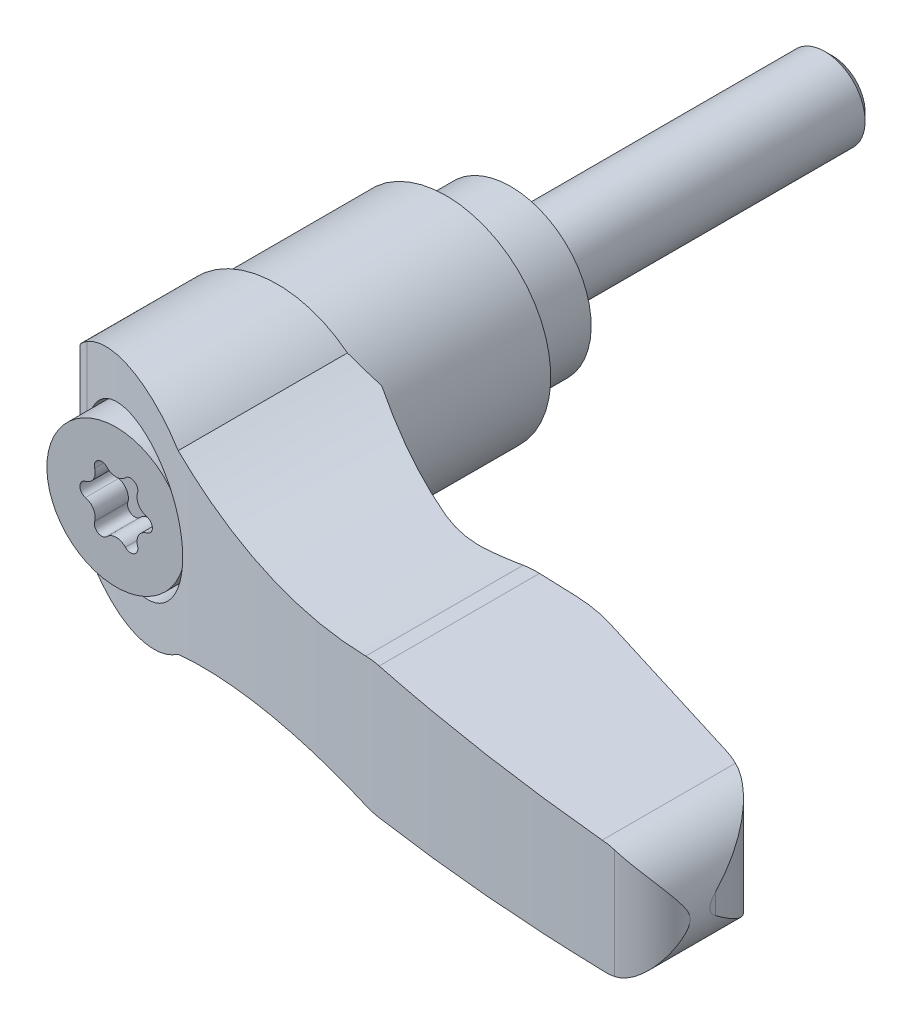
ISO-10303-21;
HEADER;
FILE_DESCRIPTION(('STEP AP214'),'2;1');
FILE_NAME('part.step','',(''),(''),'','','');
FILE_SCHEMA(('AUTOMOTIVE_DESIGN { 1 0 10303 214 1 1 1 1 }'));
ENDSEC;
DATA;
#1=APPLICATION_CONTEXT('core data for automotive mechanical design processes');
#2=APPLICATION_PROTOCOL_DEFINITION('international standard','automotive_design',2000,#1);
#3=PRODUCT_CONTEXT('',#1,'mechanical');
#4=PRODUCT('Part','Part','',(#3));
#5=PRODUCT_RELATED_PRODUCT_CATEGORY('part','',(#4));
#6=PRODUCT_DEFINITION_FORMATION('','',#4);
#7=PRODUCT_DEFINITION_CONTEXT('part definition',#1,'design');
#8=PRODUCT_DEFINITION('design','',#6,#7);
#9=PRODUCT_DEFINITION_SHAPE('','',#8);
#10=(LENGTH_UNIT() NAMED_UNIT(*) SI_UNIT(.MILLI.,.METRE.));
#11=(NAMED_UNIT(*) PLANE_ANGLE_UNIT() SI_UNIT($,.RADIAN.));
#12=(NAMED_UNIT(*) SI_UNIT($,.STERADIAN.) SOLID_ANGLE_UNIT());
#13=UNCERTAINTY_MEASURE_WITH_UNIT(LENGTH_MEASURE(1.E-05),#10,'distance_accuracy_value','');
#14=(GEOMETRIC_REPRESENTATION_CONTEXT(3) GLOBAL_UNCERTAINTY_ASSIGNED_CONTEXT((#13)) GLOBAL_UNIT_ASSIGNED_CONTEXT((#10,
#11,#12)) REPRESENTATION_CONTEXT('',''));
#15=CARTESIAN_POINT('',(0.,0.,0.));
#16=DIRECTION('',(0.,0.,1.));
#17=DIRECTION('',(1.,0.,0.));
#18=AXIS2_PLACEMENT_3D('',#15,#16,#17);
#19=CARTESIAN_POINT('',(0.,0.,-4.754266));
#20=DIRECTION('',(0.,0.,-1.));
#21=DIRECTION('',(0.,1.,0.));
#22=AXIS2_PLACEMENT_3D('',#19,#20,#21);
#23=CYLINDRICAL_SURFACE('',#22,2.5);
#24=CARTESIAN_POINT('',(0.,0.,-19.51));
#25=DIRECTION('',(0.,0.,-1.));
#26=DIRECTION('',(0.,1.,0.));
#27=AXIS2_PLACEMENT_3D('',#24,#25,#26);
#28=CIRCLE('',#27,2.5);
#29=CARTESIAN_POINT('',(0.,2.5,-19.51));
#30=VERTEX_POINT('',#29);
#31=EDGE_CURVE('E9',#30,#30,#28,.F.);
#32=ORIENTED_EDGE('',*,*,#31,.T.);
#33=EDGE_LOOP('',(#32));
#34=FACE_BOUND('',#33,.T.);
#35=CARTESIAN_POINT('',(0.,0.,0.));
#36=DIRECTION('',(0.,0.,-1.));
#37=DIRECTION('',(0.,1.,0.));
#38=AXIS2_PLACEMENT_3D('',#35,#36,#37);
#39=CIRCLE('',#38,2.5);
#40=CARTESIAN_POINT('',(0.,2.5,0.));
#41=VERTEX_POINT('',#40);
#42=EDGE_CURVE('E565',#41,#41,#39,.F.);
#43=ORIENTED_EDGE('',*,*,#42,.F.);
#44=EDGE_LOOP('',(#43));
#45=FACE_BOUND('',#44,.T.);
#46=ADVANCED_FACE('F14',(#34,#45),#23,.T.);
#47=CARTESIAN_POINT('',(3.75,0.,0.));
#48=DIRECTION('',(0.,0.,-1.));
#49=DIRECTION('',(0.,1.,0.));
#50=AXIS2_PLACEMENT_3D('',#47,#48,#49);
#51=PLANE('',#50);
#52=ORIENTED_EDGE('',*,*,#42,.T.);
#53=EDGE_LOOP('',(#52));
#54=FACE_BOUND('',#53,.T.);
#55=CARTESIAN_POINT('',(0.,0.,0.));
#56=DIRECTION('',(0.,0.,-1.));
#57=DIRECTION('',(0.,1.,0.));
#58=AXIS2_PLACEMENT_3D('',#55,#56,#57);
#59=CIRCLE('',#58,5.);
#60=CARTESIAN_POINT('',(0.,5.,0.));
#61=VERTEX_POINT('',#60);
#62=EDGE_CURVE('E725',#61,#61,#59,.F.);
#63=ORIENTED_EDGE('',*,*,#62,.F.);
#64=EDGE_LOOP('',(#63));
#65=FACE_BOUND('',#64,.T.);
#66=ADVANCED_FACE('F668',(#54,#65),#51,.T.);
#67=CARTESIAN_POINT('',(0.,0.,6.4));
#68=DIRECTION('',(0.,0.,-1.));
#69=DIRECTION('',(0.,1.,0.));
#70=AXIS2_PLACEMENT_3D('',#67,#68,#69);
#71=CYLINDRICAL_SURFACE('',#70,5.);
#72=ORIENTED_EDGE('',*,*,#62,.T.);
#73=EDGE_LOOP('',(#72));
#74=FACE_BOUND('',#73,.T.);
#75=CARTESIAN_POINT('',(0.,0.,4.55000000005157));
#76=DIRECTION('',(0.,0.,-1.));
#77=DIRECTION('',(1.,0.,0.));
#78=AXIS2_PLACEMENT_3D('',#75,#76,#77);
#79=CIRCLE('',#78,4.99999999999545);
#80=CARTESIAN_POINT('',(4.99999999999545,0.,4.55000000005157));
#81=VERTEX_POINT('',#80);
#82=EDGE_CURVE('E558',#81,#81,#79,.T.);
#83=ORIENTED_EDGE('',*,*,#82,.T.);
#84=EDGE_LOOP('',(#83));
#85=FACE_BOUND('',#84,.T.);
#86=ADVANCED_FACE('F675',(#74,#85),#71,.T.);
#87=CARTESIAN_POINT('',(0.,0.,4.30000000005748));
#88=DIRECTION('',(0.,0.,-1.));
#89=DIRECTION('',(0.,1.,0.));
#90=AXIS2_PLACEMENT_3D('',#87,#88,#89);
#91=CONICAL_SURFACE('',#90,5.24999999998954,0.785398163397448);
#92=ORIENTED_EDGE('',*,*,#82,.F.);
#93=EDGE_LOOP('',(#92));
#94=FACE_BOUND('',#93,.T.);
#95=CARTESIAN_POINT('',(0.,0.,4.3));
#96=DIRECTION('',(0.,0.,-1.));
#97=DIRECTION('',(0.,1.,0.));
#98=AXIS2_PLACEMENT_3D('',#95,#96,#97);
#99=CIRCLE('',#98,5.25);
#100=CARTESIAN_POINT('',(0.,5.25,4.3));
#101=VERTEX_POINT('',#100);
#102=EDGE_CURVE('E554',#101,#101,#99,.T.);
#103=ORIENTED_EDGE('',*,*,#102,.T.);
#104=EDGE_LOOP('',(#103));
#105=FACE_BOUND('',#104,.T.);
#106=ADVANCED_FACE('F683',(#94,#105),#91,.F.);
#107=CARTESIAN_POINT('',(0.,0.,3.65));
#108=DIRECTION('',(0.,0.,-1.));
#109=DIRECTION('',(0.,1.,0.));
#110=AXIS2_PLACEMENT_3D('',#107,#108,#109);
#111=CYLINDRICAL_SURFACE('',#110,5.25);
#112=ORIENTED_EDGE('',*,*,#102,.F.);
#113=EDGE_LOOP('',(#112));
#114=FACE_BOUND('',#113,.T.);
#115=CARTESIAN_POINT('',(0.,0.,4.));
#116=DIRECTION('',(0.,0.,-1.));
#117=DIRECTION('',(0.,1.,0.));
#118=AXIS2_PLACEMENT_3D('',#115,#116,#117);
#119=CIRCLE('',#118,5.25);
#120=CARTESIAN_POINT('',(0.,5.25,4.));
#121=VERTEX_POINT('',#120);
#122=EDGE_CURVE('E713',#121,#121,#119,.F.);
#123=ORIENTED_EDGE('',*,*,#122,.F.);
#124=EDGE_LOOP('',(#123));
#125=FACE_BOUND('',#124,.T.);
#126=ADVANCED_FACE('F690',(#114,#125),#111,.F.);
#127=CARTESIAN_POINT('',(-6.36002265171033,-14.,4.));
#128=DIRECTION('',(0.707106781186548,0.,0.707106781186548));
#129=DIRECTION('',(-0.707106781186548,0.,0.707106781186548));
#130=AXIS2_PLACEMENT_3D('',#127,#128,#129);
#131=PLANE('',#130);
#132=DIRECTION('',(0.,1.,0.));
#133=VECTOR('',#132,1.);
#134=CARTESIAN_POINT('',(-6.36002265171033,0.,4.));
#135=LINE('',#134,#133);
#136=CARTESIAN_POINT('',(-6.36002265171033,-1.38824072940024,4.));
#137=VERTEX_POINT('',#136);
#138=CARTESIAN_POINT('',(-6.36002265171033,1.38824072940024,4.));
#139=VERTEX_POINT('',#138);
#140=EDGE_CURVE('E715',#137,#139,#135,.T.);
#141=ORIENTED_EDGE('',*,*,#140,.F.);
#142=CARTESIAN_POINT('',(-0.0100000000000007,0.,-2.35002265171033));
#143=DIRECTION('',(0.707106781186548,0.,0.707106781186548));
#144=DIRECTION('',(-0.707106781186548,0.,0.707106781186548));
#145=AXIS2_PLACEMENT_3D('',#142,#143,#144);
#146=ELLIPSE('',#145,9.19238815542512,6.5);
#147=EDGE_CURVE('E557',#139,#137,#146,.T.);
#148=ORIENTED_EDGE('',*,*,#147,.F.);
#149=EDGE_LOOP('',(#141,#148));
#150=FACE_BOUND('',#149,.T.);
#151=ADVANCED_FACE('F694',(#150),#131,.F.);
#152=CARTESIAN_POINT('',(-3.26,0.,4.));
#153=DIRECTION('',(0.,0.,-1.));
#154=DIRECTION('',(0.,1.,0.));
#155=AXIS2_PLACEMENT_3D('',#152,#153,#154);
#156=PLANE('',#155);
#157=CARTESIAN_POINT('',(-0.00999999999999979,0.,4.));
#158=DIRECTION('',(0.,0.,1.));
#159=DIRECTION('',(-1.,0.,0.));
#160=AXIS2_PLACEMENT_3D('',#157,#158,#159);
#161=CIRCLE('',#160,6.5);
#162=EDGE_CURVE('E709',#137,#139,#161,.T.);
#163=ORIENTED_EDGE('',*,*,#162,.F.);
#164=ORIENTED_EDGE('',*,*,#140,.T.);
#165=EDGE_LOOP('',(#163,#164));
#166=FACE_BOUND('',#165,.T.);
#167=ORIENTED_EDGE('',*,*,#122,.T.);
#168=EDGE_LOOP('',(#167));
#169=FACE_BOUND('',#168,.T.);
#170=ADVANCED_FACE('F697',(#166,#169),#156,.T.);
#171=CARTESIAN_POINT('',(39.9389658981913,-8.,27.2042491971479));
#172=DIRECTION('',(0.989626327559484,0.,-0.143665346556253));
#173=DIRECTION('',(0.143665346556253,0.,0.989626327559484));
#174=AXIS2_PLACEMENT_3D('',#171,#172,#173);
#175=PLANE('',#174);
#176=CARTESIAN_POINT('',(36.5,0.,3.51522972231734));
#177=DIRECTION('',(0.989626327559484,0.,-0.143665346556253));
#178=DIRECTION('',(0.143665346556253,0.,0.989626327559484));
#179=AXIS2_PLACEMENT_3D('',#176,#177,#178);
#180=ELLIPSE('',#179,24.3621728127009,3.5);
#181=CARTESIAN_POINT('',(39.9389658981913,-0.650779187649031,27.2042491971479));
#182=VERTEX_POINT('',#181);
#183=CARTESIAN_POINT('',(39.9389658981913,0.650779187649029,27.2042491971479));
#184=VERTEX_POINT('',#183);
#185=EDGE_CURVE('E461',#182,#184,#180,.F.);
#186=ORIENTED_EDGE('',*,*,#185,.F.);
#187=DIRECTION('',(0.,-1.,0.));
#188=VECTOR('',#187,1.);
#189=CARTESIAN_POINT('',(39.9389658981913,-8.,27.2042491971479));
#190=LINE('',#189,#188);
#191=EDGE_CURVE('E848',#184,#182,#190,.T.);
#192=ORIENTED_EDGE('',*,*,#191,.F.);
#193=EDGE_LOOP('',(#186,#192));
#194=FACE_BOUND('',#193,.T.);
#195=ADVANCED_FACE('F485',(#194),#175,.T.);
#196=CARTESIAN_POINT('',(33.8626602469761,-8.,28.0863544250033));
#197=DIRECTION('',(0.,-1.,0.));
#198=DIRECTION('',(1.,0.,0.));
#199=AXIS2_PLACEMENT_3D('',#196,#197,#198);
#200=CYLINDRICAL_SURFACE('',#199,6.14);
#201=ORIENTED_EDGE('',*,*,#191,.T.);
#202=CARTESIAN_POINT('',(36.5,-3.5,22.5416236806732));
#203=CARTESIAN_POINT('',(36.6061539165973,-3.50000941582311,22.5920863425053));
#204=CARTESIAN_POINT('',(36.7107657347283,-3.49517280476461,22.6456099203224));
#205=CARTESIAN_POINT('',(36.9160027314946,-3.47671082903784,22.758101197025));
#206=CARTESIAN_POINT('',(37.0166343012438,-3.46310021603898,22.8170596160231));
#207=CARTESIAN_POINT('',(37.2123479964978,-3.42816986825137,22.9392782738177));
#208=CARTESIAN_POINT('',(37.3074768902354,-3.40693163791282,23.002487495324));
#209=CARTESIAN_POINT('',(37.4929223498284,-3.3575759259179,23.13320682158));
#210=CARTESIAN_POINT('',(37.5832363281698,-3.32945478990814,23.2007191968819));
#211=CARTESIAN_POINT('',(37.7830795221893,-3.25850520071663,23.358740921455));
#212=CARTESIAN_POINT('',(37.8909927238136,-3.21376078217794,23.4504360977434));
#213=CARTESIAN_POINT('',(38.0982482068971,-3.11588681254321,23.6389903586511));
#214=CARTESIAN_POINT('',(38.1975840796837,-3.06275107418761,23.7358532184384));
#215=CARTESIAN_POINT('',(38.3880468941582,-2.94917464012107,23.9343090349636));
#216=CARTESIAN_POINT('',(38.4791322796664,-2.88870020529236,24.0359224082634));
#217=CARTESIAN_POINT('',(38.6526412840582,-2.76182607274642,24.2426721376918));
#218=CARTESIAN_POINT('',(38.7350674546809,-2.69542813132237,24.3478074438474));
#219=CARTESIAN_POINT('',(38.9229341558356,-2.52996933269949,24.6038856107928));
#220=CARTESIAN_POINT('',(39.0243159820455,-2.42850340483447,24.7562617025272));
#221=CARTESIAN_POINT('',(39.2111706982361,-2.21796613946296,25.0654781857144));
#222=CARTESIAN_POINT('',(39.2966363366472,-2.10889136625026,25.2223205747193));
#223=CARTESIAN_POINT('',(39.452222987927,-1.88493092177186,25.5392893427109));
#224=CARTESIAN_POINT('',(39.5223498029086,-1.77004746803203,25.699414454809));
#225=CARTESIAN_POINT('',(39.6478320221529,-1.53583460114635,26.0220530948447));
#226=CARTESIAN_POINT('',(39.7031929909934,-1.41650688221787,26.1845656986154));
#227=CARTESIAN_POINT('',(39.7933776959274,-1.1901857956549,26.4900634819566));
#228=CARTESIAN_POINT('',(39.8299343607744,-1.08360162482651,26.6328455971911));
#229=CARTESIAN_POINT('',(39.8923391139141,-0.86858691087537,26.918504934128));
#230=CARTESIAN_POINT('',(39.918226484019,-0.76016469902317,27.0613798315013));
#231=CARTESIAN_POINT('',(39.9389658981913,-0.650779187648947,27.204249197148));
#232=B_SPLINE_CURVE_WITH_KNOTS('',3,(#202,#203,#204,#205,#206,#207,#208,#209,#210,#211,#212,
#213,#214,#215,#216,#217,#218,#219,#220,#221,#222,#223,#224,#225,#226,#227,#228,#229,#230,#231),
.UNSPECIFIED.,.F.,.F.,(4,2,2,2,2,2,2,2,2,2,2,2,2,2,4),(0.,0.352350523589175,0.704110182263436,
1.05221781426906,1.40051067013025,1.84538152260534,2.29058194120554,2.73791274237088,
3.18511134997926,3.81198117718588,4.43913591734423,5.06605301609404,5.69273352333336,
6.23807905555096,6.78139842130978),.UNSPECIFIED.);
#233=CARTESIAN_POINT('',(36.5,-3.5,22.5416236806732));
#234=VERTEX_POINT('',#233);
#235=EDGE_CURVE('E465',#234,#182,#232,.T.);
#236=ORIENTED_EDGE('',*,*,#235,.F.);
#237=CARTESIAN_POINT('',(33.8626602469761,-3.59762871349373,28.0863544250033));
#238=DIRECTION('',(-0.0369925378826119,0.999315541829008,0.));
#239=DIRECTION('',(-0.999315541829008,-0.0369925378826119,0.));
#240=AXIS2_PLACEMENT_3D('',#237,#238,#239);
#241=ELLIPSE('',#240,6.14420545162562,6.14);
#242=CARTESIAN_POINT('',(35.5344609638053,-3.53574220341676,22.1783359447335));
#243=VERTEX_POINT('',#242);
#244=EDGE_CURVE('E717',#234,#243,#241,.T.);
#245=ORIENTED_EDGE('',*,*,#244,.T.);
#246=DIRECTION('',(0.,-1.,0.));
#247=VECTOR('',#246,1.);
#248=CARTESIAN_POINT('',(35.5344609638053,-8.,22.1783359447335));
#249=LINE('',#248,#247);
#250=CARTESIAN_POINT('',(35.5344609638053,3.53574220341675,22.1783359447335));
#251=VERTEX_POINT('',#250);
#252=EDGE_CURVE('E539',#251,#243,#249,.T.);
#253=ORIENTED_EDGE('',*,*,#252,.F.);
#254=CARTESIAN_POINT('',(33.8626602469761,3.59762871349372,28.0863544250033));
#255=DIRECTION('',(-0.036992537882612,-0.999315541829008,0.));
#256=DIRECTION('',(0.999315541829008,-0.036992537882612,0.));
#257=AXIS2_PLACEMENT_3D('',#254,#255,#256);
#258=ELLIPSE('',#257,6.14420545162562,6.14);
#259=CARTESIAN_POINT('',(36.5,3.5,22.5416236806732));
#260=VERTEX_POINT('',#259);
#261=EDGE_CURVE('E847',#251,#260,#258,.T.);
#262=ORIENTED_EDGE('',*,*,#261,.T.);
#263=CARTESIAN_POINT('',(39.9389658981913,0.65077918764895,27.204249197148));
#264=CARTESIAN_POINT('',(39.9247028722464,0.726086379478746,27.1059853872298));
#265=CARTESIAN_POINT('',(39.9079968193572,0.800887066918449,27.0076860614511));
#266=CARTESIAN_POINT('',(39.8696347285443,0.949458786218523,26.8112602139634));
#267=CARTESIAN_POINT('',(39.8479781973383,1.02322971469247,26.7131337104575));
#268=CARTESIAN_POINT('',(39.7995979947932,1.169880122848,26.5170899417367));
#269=CARTESIAN_POINT('',(39.7728626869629,1.24275713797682,26.4191736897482));
#270=CARTESIAN_POINT('',(39.7142815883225,1.38725410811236,26.2239599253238));
#271=CARTESIAN_POINT('',(39.6824358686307,1.4588740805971,26.1266624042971));
#272=CARTESIAN_POINT('',(39.5782917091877,1.67318502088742,25.8337016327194));
#273=CARTESIAN_POINT('',(39.4979263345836,1.81366367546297,25.6391889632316));
#274=CARTESIAN_POINT('',(39.3150854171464,2.08619457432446,25.2551202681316));
#275=CARTESIAN_POINT('',(39.2126344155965,2.218255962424,25.0655590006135));
#276=CARTESIAN_POINT('',(38.9595027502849,2.49877334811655,24.6523338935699));
#277=CARTESIAN_POINT('',(38.8031801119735,2.64456339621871,24.4302018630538));
#278=CARTESIAN_POINT('',(38.5417124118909,2.84488994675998,24.1082756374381));
#279=CARTESIAN_POINT('',(38.4501831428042,2.90854134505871,24.0029632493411));
#280=CARTESIAN_POINT('',(38.2579442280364,3.02861213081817,23.7967186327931));
#281=CARTESIAN_POINT('',(38.1572360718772,3.08503268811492,23.6957856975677));
#282=CARTESIAN_POINT('',(37.8892625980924,3.21757634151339,23.4457323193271));
#283=CARTESIAN_POINT('',(37.7155213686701,3.28779061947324,23.3001643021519));
#284=CARTESIAN_POINT('',(37.4396992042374,3.37286339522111,23.0946053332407));
#285=CARTESIAN_POINT('',(37.3453175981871,3.39783246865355,23.0282732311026));
#286=CARTESIAN_POINT('',(37.1517842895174,3.44019984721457,22.9003457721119));
#287=CARTESIAN_POINT('',(37.0526354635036,3.45760265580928,22.8387476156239));
#288=CARTESIAN_POINT('',(36.8781783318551,3.48029211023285,22.7372021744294));
#289=CARTESIAN_POINT('',(36.8038676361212,3.48759914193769,22.6959814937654));
#290=CARTESIAN_POINT('',(36.6533047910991,3.497455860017,22.6165121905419));
#291=CARTESIAN_POINT('',(36.5770513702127,3.50000234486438,22.5782655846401));
#292=CARTESIAN_POINT('',(36.5,3.5,22.5416236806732));
#293=B_SPLINE_CURVE_WITH_KNOTS('',3,(#263,#264,#265,#266,#267,#268,#269,#270,#271,#272,#273,
#274,#275,#276,#277,#278,#279,#280,#281,#282,#283,#284,#285,#286,#287,#288,#289,#290,#291,#292),
.UNSPECIFIED.,.F.,.F.,(4,2,2,2,2,2,2,2,2,2,2,2,2,2,4),(0.,0.373839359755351,0.747715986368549,
1.12245980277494,1.49719840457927,2.25512351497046,3.01221072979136,3.93367725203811,
4.39332639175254,4.85290107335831,5.56171222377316,5.91546495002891,6.26900683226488,
6.52468766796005,6.78054039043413),.UNSPECIFIED.);
#294=EDGE_CURVE('E434',#184,#260,#293,.T.);
#295=ORIENTED_EDGE('',*,*,#294,.F.);
#296=EDGE_LOOP('',(#201,#236,#245,#253,#262,#295));
#297=FACE_BOUND('',#296,.T.);
#298=ADVANCED_FACE('F479',(#297),#200,.T.);
#299=CARTESIAN_POINT('',(-0.0099999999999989,0.,10.28125));
#300=DIRECTION('',(0.,0.,1.));
#301=DIRECTION('',(-1.,0.,0.));
#302=AXIS2_PLACEMENT_3D('',#299,#300,#301);
#303=CYLINDRICAL_SURFACE('',#302,6.5);
#304=CARTESIAN_POINT('',(-0.00999999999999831,0.,14.5));
#305=DIRECTION('',(0.,0.,1.));
#306=DIRECTION('',(-1.,0.,0.));
#307=AXIS2_PLACEMENT_3D('',#304,#305,#306);
#308=CIRCLE('',#307,6.5);
#309=CARTESIAN_POINT('',(-6.51,0.,14.5));
#310=VERTEX_POINT('',#309);
#311=CARTESIAN_POINT('',(6.49,0.,14.5));
#312=VERTEX_POINT('',#311);
#313=EDGE_CURVE('E850',#310,#312,#308,.T.);
#314=ORIENTED_EDGE('',*,*,#313,.F.);
#315=CARTESIAN_POINT('',(-0.00999999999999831,0.,14.5));
#316=DIRECTION('',(0.,0.,1.));
#317=DIRECTION('',(-1.,0.,0.));
#318=AXIS2_PLACEMENT_3D('',#315,#316,#317);
#319=CIRCLE('',#318,6.5);
#320=EDGE_CURVE('E536',#312,#310,#319,.T.);
#321=ORIENTED_EDGE('',*,*,#320,.F.);
#322=EDGE_LOOP('',(#314,#321));
#323=FACE_BOUND('',#322,.T.);
#324=ORIENTED_EDGE('',*,*,#162,.T.);
#325=ORIENTED_EDGE('',*,*,#147,.T.);
#326=EDGE_LOOP('',(#324,#325));
#327=FACE_BOUND('',#326,.T.);
#328=ADVANCED_FACE('F484',(#323,#327),#303,.T.);
#329=CARTESIAN_POINT('',(-6.51,-8.,14.5));
#330=DIRECTION('',(0.,0.,-1.));
#331=DIRECTION('',(0.,1.,0.));
#332=AXIS2_PLACEMENT_3D('',#329,#330,#331);
#333=PLANE('',#332);
#334=ORIENTED_EDGE('',*,*,#313,.T.);
#335=DIRECTION('',(0.,-1.,0.));
#336=VECTOR('',#335,1.);
#337=CARTESIAN_POINT('',(6.49,-8.,14.5));
#338=LINE('',#337,#336);
#339=CARTESIAN_POINT('',(6.49,-4.77390244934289,14.5));
#340=VERTEX_POINT('',#339);
#341=EDGE_CURVE('E853',#312,#340,#338,.T.);
#342=ORIENTED_EDGE('',*,*,#341,.T.);
#343=CARTESIAN_POINT('',(14.8,-33.6,14.5));
#344=DIRECTION('',(0.,0.,1.));
#345=DIRECTION('',(0.,-1.,0.));
#346=AXIS2_PLACEMENT_3D('',#343,#344,#345);
#347=CIRCLE('',#346,30.);
#348=CARTESIAN_POINT('',(4.36278582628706,-5.47413005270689,14.5));
#349=VERTEX_POINT('',#348);
#350=EDGE_CURVE('E810',#340,#349,#347,.T.);
#351=ORIENTED_EDGE('',*,*,#350,.T.);
#352=CARTESIAN_POINT('',(0.,0.,14.5));
#353=DIRECTION('',(0.,0.,1.));
#354=DIRECTION('',(0.,-1.,0.));
#355=AXIS2_PLACEMENT_3D('',#352,#353,#354);
#356=CIRCLE('',#355,7.);
#357=CARTESIAN_POINT('',(-6.51,-2.57291663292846,14.5));
#358=VERTEX_POINT('',#357);
#359=EDGE_CURVE('E372',#358,#349,#356,.T.);
#360=ORIENTED_EDGE('',*,*,#359,.F.);
#361=DIRECTION('',(0.,-1.,0.));
#362=VECTOR('',#361,1.);
#363=CARTESIAN_POINT('',(-6.51,-8.,14.5));
#364=LINE('',#363,#362);
#365=EDGE_CURVE('E535',#310,#358,#364,.T.);
#366=ORIENTED_EDGE('',*,*,#365,.F.);
#367=EDGE_LOOP('',(#334,#342,#351,#360,#366));
#368=FACE_BOUND('',#367,.T.);
#369=ADVANCED_FACE('F490',(#368),#333,.T.);
#370=CARTESIAN_POINT('',(20.6060580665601,0.915064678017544,31.));
#371=DIRECTION('',(0.,0.,1.));
#372=DIRECTION('',(0.,-1.,0.));
#373=AXIS2_PLACEMENT_3D('',#370,#371,#372);
#374=CYLINDRICAL_SURFACE('',#373,5.);
#375=CARTESIAN_POINT('',(20.7910207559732,-4.08151303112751,28.9575923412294));
#376=CARTESIAN_POINT('',(20.6207575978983,-4.08776311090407,28.9275070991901));
#377=CARTESIAN_POINT('',(20.4510927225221,-4.08540030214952,28.8972050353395));
#378=CARTESIAN_POINT('',(20.1129595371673,-4.06344890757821,28.8361672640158));
#379=CARTESIAN_POINT('',(19.9444912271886,-4.04386032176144,28.8054315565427));
#380=CARTESIAN_POINT('',(19.7766211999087,-4.01565884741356,28.7744790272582));
#381=B_SPLINE_CURVE_WITH_KNOTS('',3,(#375,#376,#377,#378,#379,#380),.UNSPECIFIED.,.F.,.F.,(4,2,
4),(0.,0.517097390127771,1.03419478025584),.UNSPECIFIED.);
#382=CARTESIAN_POINT('',(20.7910207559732,-4.08151303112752,28.9575923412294));
#383=VERTEX_POINT('',#382);
#384=CARTESIAN_POINT('',(19.7766211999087,-4.01565884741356,28.7744790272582));
#385=VERTEX_POINT('',#384);
#386=EDGE_CURVE('E468',#383,#385,#381,.T.);
#387=ORIENTED_EDGE('',*,*,#386,.T.);
#388=DIRECTION('',(0.,0.,1.));
#389=VECTOR('',#388,1.);
#390=CARTESIAN_POINT('',(19.7766211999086,-4.01565884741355,31.));
#391=LINE('',#390,#389);
#392=CARTESIAN_POINT('',(19.7766211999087,-4.01565884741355,19.));
#393=VERTEX_POINT('',#392);
#394=EDGE_CURVE('E803',#385,#393,#391,.F.);
#395=ORIENTED_EDGE('',*,*,#394,.T.);
#396=CARTESIAN_POINT('',(20.6060580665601,0.915064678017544,19.));
#397=DIRECTION('',(0.,0.,1.));
#398=DIRECTION('',(0.,-1.,0.));
#399=AXIS2_PLACEMENT_3D('',#396,#397,#398);
#400=CIRCLE('',#399,5.);
#401=CARTESIAN_POINT('',(20.7910207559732,-4.08151303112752,19.));
#402=VERTEX_POINT('',#401);
#403=EDGE_CURVE('E857',#402,#393,#400,.F.);
#404=ORIENTED_EDGE('',*,*,#403,.F.);
#405=DIRECTION('',(0.,0.,1.));
#406=VECTOR('',#405,1.);
#407=CARTESIAN_POINT('',(20.7910207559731,-4.08151303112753,31.));
#408=LINE('',#407,#406);
#409=EDGE_CURVE('E809',#402,#383,#408,.T.);
#410=ORIENTED_EDGE('',*,*,#409,.T.);
#411=EDGE_LOOP('',(#387,#395,#404,#410));
#412=FACE_BOUND('',#411,.T.);
#413=ADVANCED_FACE('F426',(#412),#374,.T.);
#414=CARTESIAN_POINT('',(36.5,0.,31.));
#415=DIRECTION('',(0.,0.,1.));
#416=DIRECTION('',(0.,-1.,0.));
#417=AXIS2_PLACEMENT_3D('',#414,#415,#416);
#418=CYLINDRICAL_SURFACE('',#417,3.5);
#419=CARTESIAN_POINT('',(37.3240183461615,-3.40161634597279,30.8631619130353));
#420=CARTESIAN_POINT('',(37.188603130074,-3.43435641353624,30.8557619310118));
#421=CARTESIAN_POINT('',(37.0522273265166,-3.45892508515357,30.8481012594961));
#422=CARTESIAN_POINT('',(36.7775545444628,-3.49171963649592,30.8322585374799));
#423=CARTESIAN_POINT('',(36.6392575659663,-3.499945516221,30.8240764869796));
#424=CARTESIAN_POINT('',(36.5,-3.5,30.815633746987));
#425=B_SPLINE_CURVE_WITH_KNOTS('',3,(#419,#420,#421,#422,#423,#424),.UNSPECIFIED.,.F.,.F.,(4,2,
4),(0.,0.416348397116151,0.832696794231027),.UNSPECIFIED.);
#426=CARTESIAN_POINT('',(37.3240183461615,-3.40161634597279,30.8631619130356));
#427=VERTEX_POINT('',#426);
#428=CARTESIAN_POINT('',(36.5,-3.5,30.815633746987));
#429=VERTEX_POINT('',#428);
#430=EDGE_CURVE('E446',#427,#429,#425,.T.);
#431=ORIENTED_EDGE('',*,*,#430,.T.);
#432=DIRECTION('',(0.,0.,1.));
#433=VECTOR('',#432,1.);
#434=CARTESIAN_POINT('',(36.5,-3.5,31.));
#435=LINE('',#434,#433);
#436=EDGE_CURVE('E820',#429,#234,#435,.F.);
#437=ORIENTED_EDGE('',*,*,#436,.T.);
#438=ORIENTED_EDGE('',*,*,#235,.T.);
#439=ORIENTED_EDGE('',*,*,#185,.T.);
#440=ORIENTED_EDGE('',*,*,#294,.T.);
#441=DIRECTION('',(0.,0.,1.));
#442=VECTOR('',#441,1.);
#443=CARTESIAN_POINT('',(36.5,3.5,31.));
#444=LINE('',#443,#442);
#445=CARTESIAN_POINT('',(36.5,3.5,30.815633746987));
#446=VERTEX_POINT('',#445);
#447=EDGE_CURVE('E414',#260,#446,#444,.T.);
#448=ORIENTED_EDGE('',*,*,#447,.T.);
#449=CARTESIAN_POINT('',(36.5,3.5,30.815633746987));
#450=CARTESIAN_POINT('',(36.6392575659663,3.499945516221,30.8240764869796));
#451=CARTESIAN_POINT('',(36.7775545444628,3.49171963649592,30.8322585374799));
#452=CARTESIAN_POINT('',(37.0522273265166,3.45892508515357,30.8481012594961));
#453=CARTESIAN_POINT('',(37.188603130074,3.43435641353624,30.8557619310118));
#454=CARTESIAN_POINT('',(37.3240183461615,3.40161634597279,30.8631619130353));
#455=B_SPLINE_CURVE_WITH_KNOTS('',3,(#449,#450,#451,#452,#453,#454),.UNSPECIFIED.,.F.,.F.,(4,2,
4),(0.,0.416348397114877,0.832696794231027),.UNSPECIFIED.);
#456=CARTESIAN_POINT('',(37.3240183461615,3.40161634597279,30.8631619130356));
#457=VERTEX_POINT('',#456);
#458=EDGE_CURVE('E452',#446,#457,#455,.T.);
#459=ORIENTED_EDGE('',*,*,#458,.T.);
#460=CARTESIAN_POINT('',(37.3240183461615,-3.40161634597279,30.8631619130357));
#461=CARTESIAN_POINT('',(37.391971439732,-3.38517327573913,30.8668921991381));
#462=CARTESIAN_POINT('',(37.4595366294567,-3.36663320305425,30.8678982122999));
#463=CARTESIAN_POINT('',(37.5932555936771,-3.32560440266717,30.8647814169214));
#464=CARTESIAN_POINT('',(37.6594109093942,-3.30312026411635,30.8606645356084));
#465=CARTESIAN_POINT('',(37.7892420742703,-3.25463078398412,30.8476880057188));
#466=CARTESIAN_POINT('',(37.8529349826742,-3.22865926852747,30.8388717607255));
#467=CARTESIAN_POINT('',(37.9780608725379,-3.17332967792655,30.8169101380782));
#468=CARTESIAN_POINT('',(38.0394932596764,-3.14397072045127,30.8037636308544));
#469=CARTESIAN_POINT('',(38.2193405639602,-3.05154774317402,30.7585650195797));
#470=CARTESIAN_POINT('',(38.3339861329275,-2.98387991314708,30.7206782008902));
#471=CARTESIAN_POINT('',(38.5517467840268,-2.83858348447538,30.6324207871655));
#472=CARTESIAN_POINT('',(38.6548343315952,-2.76093200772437,30.5820212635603));
#473=CARTESIAN_POINT('',(38.8266237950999,-2.61655584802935,30.4842690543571));
#474=CARTESIAN_POINT('',(38.8977926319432,-2.55140368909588,30.4388637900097));
#475=CARTESIAN_POINT('',(39.0330318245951,-2.41719472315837,30.3433991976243));
#476=CARTESIAN_POINT('',(39.0970985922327,-2.34813596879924,30.2933375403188));
#477=CARTESIAN_POINT('',(39.2184581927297,-2.20651617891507,30.1893556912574));
#478=CARTESIAN_POINT('',(39.2757265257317,-2.13394372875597,30.1354226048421));
#479=CARTESIAN_POINT('',(39.3834200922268,-1.9860149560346,30.0247265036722));
#480=CARTESIAN_POINT('',(39.4338475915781,-1.91065956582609,29.9679644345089));
#481=CARTESIAN_POINT('',(39.542421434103,-1.73419420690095,29.8348143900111));
#482=CARTESIAN_POINT('',(39.598263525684,-1.63221056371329,29.7576996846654));
#483=CARTESIAN_POINT('',(39.699250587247,-1.42414609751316,29.601672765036));
#484=CARTESIAN_POINT('',(39.7443776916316,-1.31805876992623,29.5227577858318));
#485=CARTESIAN_POINT('',(39.8239747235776,-1.10201279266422,29.3659397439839));
#486=CARTESIAN_POINT('',(39.8584944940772,-0.992075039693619,29.2880336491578));
#487=CARTESIAN_POINT('',(39.9024720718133,-0.82253324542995,29.1754655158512));
#488=CARTESIAN_POINT('',(39.9158188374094,-0.765322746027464,29.13870216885));
#489=CARTESIAN_POINT('',(39.9398686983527,-0.648731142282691,29.0678855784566));
#490=CARTESIAN_POINT('',(39.9505741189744,-0.589352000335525,29.0338299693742));
#491=CARTESIAN_POINT('',(39.9677206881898,-0.477086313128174,28.9756719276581));
#492=CARTESIAN_POINT('',(39.974567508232,-0.424644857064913,28.9508463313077));
#493=CARTESIAN_POINT('',(39.9860225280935,-0.317100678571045,28.907341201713));
#494=CARTESIAN_POINT('',(39.9906385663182,-0.262008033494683,28.8886402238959));
#495=CARTESIAN_POINT('',(39.9966232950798,-0.160247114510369,28.8637621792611));
#496=CARTESIAN_POINT('',(39.9984523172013,-0.114054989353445,28.8558445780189));
#497=CARTESIAN_POINT('',(40.0002450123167,-0.0209847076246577,28.8480882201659));
#498=CARTESIAN_POINT('',(40.0002117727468,0.0258921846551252,28.8482360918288));
#499=CARTESIAN_POINT('',(39.9982952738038,0.118672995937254,28.8565205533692));
#500=CARTESIAN_POINT('',(39.9964185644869,0.164579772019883,28.8646288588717));
#501=CARTESIAN_POINT('',(39.9910078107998,0.254792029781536,28.8870889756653));
#502=CARTESIAN_POINT('',(39.9874686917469,0.299092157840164,28.9014598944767));
#503=CARTESIAN_POINT('',(39.9768286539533,0.407331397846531,28.9425912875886));
#504=CARTESIAN_POINT('',(39.9688318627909,0.470155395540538,28.9719647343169));
#505=CARTESIAN_POINT('',(39.9499914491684,0.592804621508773,29.0357410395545));
#506=CARTESIAN_POINT('',(39.9391403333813,0.652621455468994,29.0701570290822));
#507=CARTESIAN_POINT('',(39.9146680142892,0.770512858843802,29.1419527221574));
#508=CARTESIAN_POINT('',(39.9010255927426,0.828569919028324,29.1793537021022));
#509=CARTESIAN_POINT('',(39.8711029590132,0.942947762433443,29.2555520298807));
#510=CARTESIAN_POINT('',(39.8548256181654,0.999270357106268,29.2943478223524));
#511=CARTESIAN_POINT('',(39.8016739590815,1.1674299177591,29.4125134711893));
#512=CARTESIAN_POINT('',(39.7607265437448,1.27728939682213,29.4929030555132));
#513=CARTESIAN_POINT('',(39.6677865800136,1.49294867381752,29.6529500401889));
#514=CARTESIAN_POINT('',(39.6157834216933,1.59874445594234,29.7326066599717));
#515=CARTESIAN_POINT('',(39.5005966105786,1.80564912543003,29.8886982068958));
#516=CARTESIAN_POINT('',(39.4374685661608,1.90677830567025,29.9651469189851));
#517=CARTESIAN_POINT('',(39.2994325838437,2.10420227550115,30.1133265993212));
#518=CARTESIAN_POINT('',(39.2245348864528,2.20050117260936,30.1850615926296));
#519=CARTESIAN_POINT('',(39.0442952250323,2.40820732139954,30.3372677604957));
#520=CARTESIAN_POINT('',(38.9358891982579,2.51819093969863,30.4161164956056));
#521=CARTESIAN_POINT('',(38.7000552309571,2.72661786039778,30.559662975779));
#522=CARTESIAN_POINT('',(38.5726400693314,2.82506883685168,30.6243701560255));
#523=CARTESIAN_POINT('',(38.3254291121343,2.98922527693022,30.7237895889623));
#524=CARTESIAN_POINT('',(38.2087731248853,3.05759969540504,30.7618633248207));
#525=CARTESIAN_POINT('',(37.9650872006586,3.18151973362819,30.8217517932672));
#526=CARTESIAN_POINT('',(37.8380870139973,3.23710049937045,30.8436114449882));
#527=CARTESIAN_POINT('',(37.6449762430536,3.3080955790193,30.8616374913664));
#528=CARTESIAN_POINT('',(37.5816159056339,3.32934954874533,30.8652564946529));
#529=CARTESIAN_POINT('',(37.4536360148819,3.36824327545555,30.867801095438));
#530=CARTESIAN_POINT('',(37.389015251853,3.38587935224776,30.8667219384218));
#531=CARTESIAN_POINT('',(37.3240183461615,3.40161634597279,30.8631619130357));
#532=B_SPLINE_CURVE_WITH_KNOTS('',3,(#460,#461,#462,#463,#464,#465,#466,#467,#468,#469,#470,
#471,#472,#473,#474,#475,#476,#477,#478,#479,#480,#481,#482,#483,#484,#485,#486,#487,#488,#489,
#490,#491,#492,#493,#494,#495,#496,#497,#498,#499,#500,#501,#502,#503,#504,#505,#506,#507,#508,
#509,#510,#511,#512,#513,#514,#515,#516,#517,#518,#519,#520,#521,#522,#523,#524,#525,#526,#527,
#528,#529,#530,#531),.UNSPECIFIED.,.F.,.F.,(4,2,2,2,2,2,2,2,2,2,2,2,2,2,2,2,2,2,2,2,2,2,2,2,2,2,
2,2,2,2,2,2,2,2,2,4),(0.,0.20991378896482,0.419584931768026,0.62735226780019,0.83517384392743,
1.2486492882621,1.66308971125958,1.98257890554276,2.30222878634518,2.62299771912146,
2.94366014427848,3.36167065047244,3.78037330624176,4.19707731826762,4.40489951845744,
4.61253810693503,4.78756393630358,4.9619702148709,5.10204921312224,5.24189598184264,
5.38124764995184,5.52102749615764,5.72989301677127,5.9393124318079,6.15038720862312,
6.36123350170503,6.7871576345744,7.21349237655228,7.63775356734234,8.06164764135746,
8.58013018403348,9.09826573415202,9.51811060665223,9.9367879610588,10.1373304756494,
10.3380759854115),.UNSPECIFIED.);
#533=EDGE_CURVE('E406',#427,#457,#532,.T.);
#534=ORIENTED_EDGE('',*,*,#533,.F.);
#535=EDGE_LOOP('',(#431,#437,#438,#439,#440,#448,#459,#534));
#536=FACE_BOUND('',#535,.T.);
#537=ADVANCED_FACE('F420',(#536),#418,.T.);
#538=CARTESIAN_POINT('',(23.0466685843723,-8.,28.05));
#539=DIRECTION('',(0.,-1.,0.));
#540=DIRECTION('',(1.,0.,0.));
#541=AXIS2_PLACEMENT_3D('',#538,#539,#540);
#542=CYLINDRICAL_SURFACE('',#541,9.05000000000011);
#543=CARTESIAN_POINT('',(23.0466685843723,3.99801374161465,28.05));
#544=DIRECTION('',(-0.036992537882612,-0.999315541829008,0.));
#545=DIRECTION('',(0.999315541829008,-0.036992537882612,0.));
#546=AXIS2_PLACEMENT_3D('',#543,#544,#545);
#547=ELLIPSE('',#546,9.05619858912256,9.05000000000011);
#548=CARTESIAN_POINT('',(23.0466685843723,3.99801374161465,19.));
#549=VERTEX_POINT('',#548);
#550=CARTESIAN_POINT('',(25.5108048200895,3.90679665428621,19.34192715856));
#551=VERTEX_POINT('',#550);
#552=EDGE_CURVE('E402',#549,#551,#547,.T.);
#553=ORIENTED_EDGE('',*,*,#552,.T.);
#554=DIRECTION('',(0.,-1.,0.));
#555=VECTOR('',#554,1.);
#556=CARTESIAN_POINT('',(25.5108048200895,-8.,19.34192715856));
#557=LINE('',#556,#555);
#558=CARTESIAN_POINT('',(25.5108048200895,-3.90679665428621,19.34192715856));
#559=VERTEX_POINT('',#558);
#560=EDGE_CURVE('E459',#559,#551,#557,.F.);
#561=ORIENTED_EDGE('',*,*,#560,.F.);
#562=CARTESIAN_POINT('',(23.0466685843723,-3.99801374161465,28.05));
#563=DIRECTION('',(-0.0369925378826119,0.999315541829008,0.));
#564=DIRECTION('',(-0.999315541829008,-0.0369925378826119,0.));
#565=AXIS2_PLACEMENT_3D('',#562,#563,#564);
#566=ELLIPSE('',#565,9.05619858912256,9.05000000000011);
#567=CARTESIAN_POINT('',(23.0466685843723,-3.99801374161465,19.));
#568=VERTEX_POINT('',#567);
#569=EDGE_CURVE('E416',#559,#568,#566,.T.);
#570=ORIENTED_EDGE('',*,*,#569,.T.);
#571=DIRECTION('',(0.,1.,0.));
#572=VECTOR('',#571,1.);
#573=CARTESIAN_POINT('',(23.0466685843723,-8.,19.));
#574=LINE('',#573,#572);
#575=EDGE_CURVE('E543',#549,#568,#574,.F.);
#576=ORIENTED_EDGE('',*,*,#575,.F.);
#577=EDGE_LOOP('',(#553,#561,#570,#576));
#578=FACE_BOUND('',#577,.T.);
#579=ADVANCED_FACE('F425',(#578),#542,.T.);
#580=CARTESIAN_POINT('',(25.5108048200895,-8.,19.34192715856));
#581=DIRECTION('',(0.272280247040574,0.,-0.962217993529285));
#582=DIRECTION('',(0.962217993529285,0.,0.272280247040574));
#583=AXIS2_PLACEMENT_3D('',#580,#581,#582);
#584=PLANE('',#583);
#585=DIRECTION('',(0.961608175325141,-0.0355966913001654,0.272107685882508));
#586=VECTOR('',#585,1.);
#587=CARTESIAN_POINT('',(25.5108048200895,3.90679665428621,19.34192715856));
#588=LINE('',#587,#586);
#589=EDGE_CURVE('E404',#551,#251,#588,.T.);
#590=ORIENTED_EDGE('',*,*,#589,.T.);
#591=ORIENTED_EDGE('',*,*,#252,.T.);
#592=DIRECTION('',(-0.961608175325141,-0.0355966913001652,-0.272107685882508));
#593=VECTOR('',#592,1.);
#594=CARTESIAN_POINT('',(35.5344609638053,-3.53574220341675,22.1783359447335));
#595=LINE('',#594,#593);
#596=EDGE_CURVE('E817',#243,#559,#595,.T.);
#597=ORIENTED_EDGE('',*,*,#596,.T.);
#598=ORIENTED_EDGE('',*,*,#560,.T.);
#599=EDGE_LOOP('',(#590,#591,#597,#598));
#600=FACE_BOUND('',#599,.T.);
#601=ADVANCED_FACE('F875',(#600),#584,.T.);
#602=CARTESIAN_POINT('',(20.60605806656,-0.915064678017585,31.));
#603=DIRECTION('',(0.,0.,1.));
#604=DIRECTION('',(0.,-1.,0.));
#605=AXIS2_PLACEMENT_3D('',#602,#603,#604);
#606=CYLINDRICAL_SURFACE('',#605,5.00000000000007);
#607=CARTESIAN_POINT('',(19.7766211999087,4.01565884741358,28.7744790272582));
#608=CARTESIAN_POINT('',(19.9444912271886,4.04386032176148,28.8054315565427));
#609=CARTESIAN_POINT('',(20.1129595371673,4.06344890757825,28.8361672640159));
#610=CARTESIAN_POINT('',(20.4510927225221,4.08540030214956,28.8972050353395));
#611=CARTESIAN_POINT('',(20.6207575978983,4.08776311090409,28.9275070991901));
#612=CARTESIAN_POINT('',(20.7910207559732,4.08151303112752,28.9575923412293));
#613=B_SPLINE_CURVE_WITH_KNOTS('',3,(#607,#608,#609,#610,#611,#612),.UNSPECIFIED.,.F.,.F.,(4,2,
4),(0.,0.517097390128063,1.03419478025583),.UNSPECIFIED.);
#614=CARTESIAN_POINT('',(19.7766211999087,4.01565884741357,28.7744790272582));
#615=VERTEX_POINT('',#614);
#616=CARTESIAN_POINT('',(20.7910207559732,4.08151303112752,28.9575923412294));
#617=VERTEX_POINT('',#616);
#618=EDGE_CURVE('E542',#615,#617,#613,.T.);
#619=ORIENTED_EDGE('',*,*,#618,.T.);
#620=DIRECTION('',(0.,0.,1.));
#621=VECTOR('',#620,1.);
#622=CARTESIAN_POINT('',(20.7910207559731,4.08151303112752,31.));
#623=LINE('',#622,#621);
#624=CARTESIAN_POINT('',(20.7910207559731,4.08151303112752,19.));
#625=VERTEX_POINT('',#624);
#626=EDGE_CURVE('E828',#617,#625,#623,.F.);
#627=ORIENTED_EDGE('',*,*,#626,.T.);
#628=CARTESIAN_POINT('',(20.60605806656,-0.915064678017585,19.));
#629=DIRECTION('',(0.,0.,1.));
#630=DIRECTION('',(0.,-1.,0.));
#631=AXIS2_PLACEMENT_3D('',#628,#629,#630);
#632=CIRCLE('',#631,5.00000000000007);
#633=CARTESIAN_POINT('',(19.7766211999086,4.01565884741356,19.));
#634=VERTEX_POINT('',#633);
#635=EDGE_CURVE('E547',#634,#625,#632,.F.);
#636=ORIENTED_EDGE('',*,*,#635,.F.);
#637=DIRECTION('',(0.,0.,1.));
#638=VECTOR('',#637,1.);
#639=CARTESIAN_POINT('',(19.7766211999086,4.01565884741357,31.));
#640=LINE('',#639,#638);
#641=EDGE_CURVE('E401',#634,#615,#640,.T.);
#642=ORIENTED_EDGE('',*,*,#641,.T.);
#643=EDGE_LOOP('',(#619,#627,#636,#642));
#644=FACE_BOUND('',#643,.T.);
#645=ADVANCED_FACE('F872',(#644),#606,.T.);
#646=CARTESIAN_POINT('',(42.8289340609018,-8.,-49.9630271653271));
#647=DIRECTION('',(0.,-1.,0.));
#648=DIRECTION('',(1.,0.,0.));
#649=AXIS2_PLACEMENT_3D('',#646,#647,#648);
#650=CYLINDRICAL_SURFACE('',#649,74.0000000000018);
#651=DIRECTION('',(0.,-1.,0.));
#652=VECTOR('',#651,1.);
#653=CARTESIAN_POINT('',(14.2560355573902,-8.,18.2981585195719));
#654=LINE('',#653,#652);
#655=CARTESIAN_POINT('',(14.2560355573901,3.60493202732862,18.2981585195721));
#656=VERTEX_POINT('',#655);
#657=CARTESIAN_POINT('',(14.2560355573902,-3.60493202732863,18.2981585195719));
#658=VERTEX_POINT('',#657);
#659=EDGE_CURVE('E855',#656,#658,#654,.T.);
#660=ORIENTED_EDGE('',*,*,#659,.T.);
#661=CARTESIAN_POINT('',(14.2560355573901,-3.60493202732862,18.2981585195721));
#662=CARTESIAN_POINT('',(13.91912090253,-3.61104217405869,18.1571345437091));
#663=CARTESIAN_POINT('',(13.5833701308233,-3.62280963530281,18.0136612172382));
#664=CARTESIAN_POINT('',(12.9145226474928,-3.65743626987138,17.7219861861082));
#665=CARTESIAN_POINT('',(12.5814258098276,-3.68029491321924,17.5737847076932));
#666=CARTESIAN_POINT('',(11.5893580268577,-3.7649360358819,17.1235938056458));
#667=CARTESIAN_POINT('',(10.9347595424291,-3.84283944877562,16.8148240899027));
#668=CARTESIAN_POINT('',(9.64003521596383,-4.03983028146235,16.1808788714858));
#669=CARTESIAN_POINT('',(8.99990836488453,-4.15891482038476,15.8557045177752));
#670=CARTESIAN_POINT('',(7.73340291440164,-4.43691869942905,15.1892512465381));
#671=CARTESIAN_POINT('',(7.10709183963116,-4.5960001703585,14.8479114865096));
#672=CARTESIAN_POINT('',(6.49,-4.77390244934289,14.5));
#673=B_SPLINE_CURVE_WITH_KNOTS('',3,(#661,#662,#663,#664,#665,#666,#667,#668,#669,#670,#671,
#672),.UNSPECIFIED.,.F.,.F.,(4,2,2,2,2,4),(0.,1.09575278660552,2.19145321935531,
4.37360080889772,6.55559577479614,8.74658240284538),.UNSPECIFIED.);
#674=EDGE_CURVE('E356',#658,#340,#673,.T.);
#675=ORIENTED_EDGE('',*,*,#674,.T.);
#676=ORIENTED_EDGE('',*,*,#341,.F.);
#677=DIRECTION('',(0.,1.,0.));
#678=VECTOR('',#677,1.);
#679=CARTESIAN_POINT('',(6.49,-8.,14.5));
#680=LINE('',#679,#678);
#681=CARTESIAN_POINT('',(6.49,4.77390244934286,14.5));
#682=VERTEX_POINT('',#681);
#683=EDGE_CURVE('E546',#682,#312,#680,.F.);
#684=ORIENTED_EDGE('',*,*,#683,.F.);
#685=CARTESIAN_POINT('',(6.49,4.77390244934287,14.5));
#686=CARTESIAN_POINT('',(7.10709183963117,4.59600017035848,14.8479114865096));
#687=CARTESIAN_POINT('',(7.73340291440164,4.43691869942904,15.1892512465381));
#688=CARTESIAN_POINT('',(8.99990836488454,4.15891482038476,15.8557045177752));
#689=CARTESIAN_POINT('',(9.64003521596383,4.03983028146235,16.1808788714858));
#690=CARTESIAN_POINT('',(10.9347595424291,3.84283944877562,16.8148240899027));
#691=CARTESIAN_POINT('',(11.5893580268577,3.7649360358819,17.1235938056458));
#692=CARTESIAN_POINT('',(12.5814258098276,3.68029491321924,17.5737847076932));
#693=CARTESIAN_POINT('',(12.9145226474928,3.65743626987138,17.7219861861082));
#694=CARTESIAN_POINT('',(13.5833701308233,3.62280963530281,18.0136612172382));
#695=CARTESIAN_POINT('',(13.91912090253,3.61104217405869,18.1571345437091));
#696=CARTESIAN_POINT('',(14.2560355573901,3.60493202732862,18.2981585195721));
#697=B_SPLINE_CURVE_WITH_KNOTS('',3,(#685,#686,#687,#688,#689,#690,#691,#692,#693,#694,#695,
#696),.UNSPECIFIED.,.F.,.F.,(4,2,2,2,2,4),(0.,2.19098662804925,4.37298159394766,
6.55512918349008,7.65082961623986,8.74658240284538),.UNSPECIFIED.);
#698=EDGE_CURVE('E392',#682,#656,#697,.T.);
#699=ORIENTED_EDGE('',*,*,#698,.T.);
#700=EDGE_LOOP('',(#660,#675,#676,#684,#699));
#701=FACE_BOUND('',#700,.T.);
#702=ADVANCED_FACE('F379',(#701),#650,.F.);
#703=CARTESIAN_POINT('',(17.7504238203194,-8.,9.95000000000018));
#704=DIRECTION('',(0.,-1.,0.));
#705=DIRECTION('',(1.,0.,0.));
#706=AXIS2_PLACEMENT_3D('',#703,#704,#705);
#707=CYLINDRICAL_SURFACE('',#706,9.04999999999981);
#708=ORIENTED_EDGE('',*,*,#659,.F.);
#709=CARTESIAN_POINT('',(14.2560355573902,3.60493202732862,18.2981585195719));
#710=CARTESIAN_POINT('',(14.483816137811,3.60077563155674,18.3935396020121));
#711=CARTESIAN_POINT('',(14.7155749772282,3.59919241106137,18.4795580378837));
#712=CARTESIAN_POINT('',(15.1854578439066,3.60156277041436,18.6324166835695));
#713=CARTESIAN_POINT('',(15.4235855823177,3.60551965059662,18.699245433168));
#714=CARTESIAN_POINT('',(15.9002362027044,3.61924836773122,18.8121846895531));
#715=CARTESIAN_POINT('',(16.1386829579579,3.62891979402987,18.8586293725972));
#716=CARTESIAN_POINT('',(16.6180975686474,3.65418161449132,18.9321530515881));
#717=CARTESIAN_POINT('',(16.8590635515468,3.66976787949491,18.9592455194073));
#718=CARTESIAN_POINT('',(17.2084780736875,3.69663888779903,18.9844088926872));
#719=CARTESIAN_POINT('',(17.3166030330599,3.70554405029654,18.9902441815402));
#720=CARTESIAN_POINT('',(17.5333084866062,3.72457700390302,18.9980471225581));
#721=CARTESIAN_POINT('',(17.641889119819,3.73470940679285,18.9999996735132));
#722=CARTESIAN_POINT('',(17.7504238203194,3.74543587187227,19.));
#723=B_SPLINE_CURVE_WITH_KNOTS('',3,(#709,#710,#711,#712,#713,#714,#715,#716,#717,#718,#719,
#720,#721,#722),.UNSPECIFIED.,.F.,.F.,(4,2,2,2,2,2,4),(0.,0.740736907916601,1.48191527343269,
2.2104421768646,2.93846142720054,3.26434207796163,3.59148772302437),.UNSPECIFIED.);
#724=CARTESIAN_POINT('',(17.7504238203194,3.74543587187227,19.));
#725=VERTEX_POINT('',#724);
#726=EDGE_CURVE('E385',#656,#725,#723,.T.);
#727=ORIENTED_EDGE('',*,*,#726,.T.);
#728=DIRECTION('',(0.,1.,0.));
#729=VECTOR('',#728,1.);
#730=CARTESIAN_POINT('',(17.7504238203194,-8.,19.));
#731=LINE('',#730,#729);
#732=CARTESIAN_POINT('',(17.7504238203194,-3.74543587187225,19.));
#733=VERTEX_POINT('',#732);
#734=EDGE_CURVE('E858',#733,#725,#731,.T.);
#735=ORIENTED_EDGE('',*,*,#734,.F.);
#736=CARTESIAN_POINT('',(17.7504238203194,-3.74543587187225,19.));
#737=CARTESIAN_POINT('',(17.5046390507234,-3.72111558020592,19.0000347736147));
#738=CARTESIAN_POINT('',(17.2585407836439,-3.69988852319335,18.9899888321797));
#739=CARTESIAN_POINT('',(16.7673975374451,-3.66357523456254,18.9498183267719));
#740=CARTESIAN_POINT('',(16.5223532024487,-3.64849234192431,18.9196828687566));
#741=CARTESIAN_POINT('',(16.039413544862,-3.6246526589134,18.8400993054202));
#742=CARTESIAN_POINT('',(15.8014675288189,-3.61579257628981,18.7909886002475));
#743=CARTESIAN_POINT('',(15.3302904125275,-3.60376296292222,18.6737788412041));
#744=CARTESIAN_POINT('',(15.0970562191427,-3.60058957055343,18.605692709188));
#745=CARTESIAN_POINT('',(14.7640124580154,-3.59984438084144,18.4937500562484));
#746=CARTESIAN_POINT('',(14.6616681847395,-3.60014663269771,18.4572847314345));
#747=CARTESIAN_POINT('',(14.4579719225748,-3.60177627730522,18.3805483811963));
#748=CARTESIAN_POINT('',(14.3566253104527,-3.60310763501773,18.3402631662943));
#749=CARTESIAN_POINT('',(14.2560355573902,-3.60493202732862,18.2981585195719));
#750=B_SPLINE_CURVE_WITH_KNOTS('',3,(#736,#737,#738,#739,#740,#741,#742,#743,#744,#745,#746,
#747,#748,#749),.UNSPECIFIED.,.F.,.F.,(4,2,2,2,2,2,4),(0.,0.740745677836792,1.48189337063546,
2.21042785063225,2.93846742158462,3.26434594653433,3.59148632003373),.UNSPECIFIED.);
#751=EDGE_CURVE('E364',#733,#658,#750,.T.);
#752=ORIENTED_EDGE('',*,*,#751,.T.);
#753=EDGE_LOOP('',(#708,#727,#735,#752));
#754=FACE_BOUND('',#753,.T.);
#755=ADVANCED_FACE('F374',(#754),#707,.F.);
#756=CARTESIAN_POINT('',(17.7504238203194,-8.,19.));
#757=DIRECTION('',(0.,0.,-1.));
#758=DIRECTION('',(0.,1.,0.));
#759=AXIS2_PLACEMENT_3D('',#756,#757,#758);
#760=PLANE('',#759);
#761=DIRECTION('',(0.999315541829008,-0.036992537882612,0.));
#762=VECTOR('',#761,1.);
#763=CARTESIAN_POINT('',(20.7910207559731,4.08151303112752,19.));
#764=LINE('',#763,#762);
#765=EDGE_CURVE('E405',#625,#549,#764,.T.);
#766=ORIENTED_EDGE('',*,*,#765,.T.);
#767=ORIENTED_EDGE('',*,*,#575,.T.);
#768=DIRECTION('',(-0.999315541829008,-0.0369925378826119,0.));
#769=VECTOR('',#768,1.);
#770=CARTESIAN_POINT('',(36.5,-3.5,19.));
#771=LINE('',#770,#769);
#772=EDGE_CURVE('E415',#568,#402,#771,.T.);
#773=ORIENTED_EDGE('',*,*,#772,.T.);
#774=ORIENTED_EDGE('',*,*,#403,.T.);
#775=CARTESIAN_POINT('',(14.8,-33.6,19.));
#776=DIRECTION('',(0.,0.,1.));
#777=DIRECTION('',(0.,-1.,0.));
#778=AXIS2_PLACEMENT_3D('',#775,#776,#777);
#779=CIRCLE('',#778,30.);
#780=EDGE_CURVE('E806',#393,#733,#779,.T.);
#781=ORIENTED_EDGE('',*,*,#780,.T.);
#782=ORIENTED_EDGE('',*,*,#734,.T.);
#783=CARTESIAN_POINT('',(14.8,33.6,19.));
#784=DIRECTION('',(0.,0.,1.));
#785=DIRECTION('',(0.,-1.,0.));
#786=AXIS2_PLACEMENT_3D('',#783,#784,#785);
#787=CIRCLE('',#786,30.);
#788=EDGE_CURVE('E391',#725,#634,#787,.T.);
#789=ORIENTED_EDGE('',*,*,#788,.T.);
#790=ORIENTED_EDGE('',*,*,#635,.T.);
#791=EDGE_LOOP('',(#766,#767,#773,#774,#781,#782,#789,#790));
#792=FACE_BOUND('',#791,.T.);
#793=ADVANCED_FACE('F378',(#792),#760,.T.);
#794=CARTESIAN_POINT('',(-6.51,-8.,14.5));
#795=DIRECTION('',(0.,0.,-1.));
#796=DIRECTION('',(0.,1.,0.));
#797=AXIS2_PLACEMENT_3D('',#794,#795,#796);
#798=PLANE('',#797);
#799=DIRECTION('',(0.,-1.,0.));
#800=VECTOR('',#799,1.);
#801=CARTESIAN_POINT('',(-6.51,-8.,14.5));
#802=LINE('',#801,#800);
#803=CARTESIAN_POINT('',(-6.51,2.57291663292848,14.5));
#804=VERTEX_POINT('',#803);
#805=EDGE_CURVE('E532',#804,#310,#802,.T.);
#806=ORIENTED_EDGE('',*,*,#805,.F.);
#807=CARTESIAN_POINT('',(0.,0.,14.5));
#808=DIRECTION('',(0.,0.,1.));
#809=DIRECTION('',(0.,-1.,0.));
#810=AXIS2_PLACEMENT_3D('',#807,#808,#809);
#811=CIRCLE('',#810,7.);
#812=CARTESIAN_POINT('',(4.36278582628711,5.47413005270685,14.5));
#813=VERTEX_POINT('',#812);
#814=EDGE_CURVE('E310',#813,#804,#811,.T.);
#815=ORIENTED_EDGE('',*,*,#814,.F.);
#816=CARTESIAN_POINT('',(14.8,33.6,14.5));
#817=DIRECTION('',(0.,0.,1.));
#818=DIRECTION('',(0.,-1.,0.));
#819=AXIS2_PLACEMENT_3D('',#816,#817,#818);
#820=CIRCLE('',#819,30.);
#821=EDGE_CURVE('E398',#813,#682,#820,.T.);
#822=ORIENTED_EDGE('',*,*,#821,.T.);
#823=ORIENTED_EDGE('',*,*,#683,.T.);
#824=ORIENTED_EDGE('',*,*,#320,.T.);
#825=EDGE_LOOP('',(#806,#815,#822,#823,#824));
#826=FACE_BOUND('',#825,.T.);
#827=ADVANCED_FACE('F928',(#826),#798,.T.);
#828=CARTESIAN_POINT('',(-6.51,-8.,18.7873257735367));
#829=DIRECTION('',(-1.,0.,0.));
#830=DIRECTION('',(0.,-1.,0.));
#831=AXIS2_PLACEMENT_3D('',#828,#829,#830);
#832=PLANE('',#831);
#833=ORIENTED_EDGE('',*,*,#805,.T.);
#834=ORIENTED_EDGE('',*,*,#365,.T.);
#835=DIRECTION('',(0.,0.,1.));
#836=VECTOR('',#835,1.);
#837=CARTESIAN_POINT('',(-6.51,-2.57291663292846,31.));
#838=LINE('',#837,#836);
#839=CARTESIAN_POINT('',(-6.51,-2.57291663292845,18.7873257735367));
#840=VERTEX_POINT('',#839);
#841=EDGE_CURVE('E551',#840,#358,#838,.F.);
#842=ORIENTED_EDGE('',*,*,#841,.F.);
#843=DIRECTION('',(0.,-1.,0.));
#844=VECTOR('',#843,1.);
#845=CARTESIAN_POINT('',(-6.51,-8.,18.7873257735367));
#846=LINE('',#845,#844);
#847=CARTESIAN_POINT('',(-6.51,2.57291663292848,18.7873257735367));
#848=VERTEX_POINT('',#847);
#849=EDGE_CURVE('E293',#848,#840,#846,.T.);
#850=ORIENTED_EDGE('',*,*,#849,.F.);
#851=DIRECTION('',(0.,0.,1.));
#852=VECTOR('',#851,1.);
#853=CARTESIAN_POINT('',(-6.51,2.57291663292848,31.));
#854=LINE('',#853,#852);
#855=EDGE_CURVE('E517',#804,#848,#854,.T.);
#856=ORIENTED_EDGE('',*,*,#855,.F.);
#857=EDGE_LOOP('',(#833,#834,#842,#850,#856));
#858=FACE_BOUND('',#857,.T.);
#859=ADVANCED_FACE('F317',(#858),#832,.T.);
#860=CARTESIAN_POINT('',(0.,0.,25.1538693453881));
#861=DIRECTION('',(0.,0.,1.));
#862=DIRECTION('',(0.,-1.,0.));
#863=AXIS2_PLACEMENT_3D('',#860,#861,#862);
#864=CONICAL_SURFACE('',#863,4.7682842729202,0.122173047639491);
#865=CARTESIAN_POINT('',(0.,0.,21.3400000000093));
#866=DIRECTION('',(0.,0.,1.));
#867=DIRECTION('',(1.,0.,0.));
#868=AXIS2_PLACEMENT_3D('',#865,#866,#867);
#869=CIRCLE('',#868,4.30000000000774);
#870=CARTESIAN_POINT('',(4.30000000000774,0.,21.3400000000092));
#871=VERTEX_POINT('',#870);
#872=EDGE_CURVE('E548',#871,#871,#869,.T.);
#873=ORIENTED_EDGE('',*,*,#872,.F.);
#874=EDGE_LOOP('',(#873));
#875=FACE_BOUND('',#874,.T.);
#876=CARTESIAN_POINT('',(-4.25177912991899,-1.08631234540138,22.0596314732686));
#877=CARTESIAN_POINT('',(-4.27354601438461,-0.997032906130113,22.0513567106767));
#878=CARTESIAN_POINT('',(-4.29261458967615,-0.907015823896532,22.0438858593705));
#879=CARTESIAN_POINT('',(-4.32530565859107,-0.725854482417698,22.0308280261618));
#880=CARTESIAN_POINT('',(-4.33892760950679,-0.63471011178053,22.0252412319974));
#881=CARTESIAN_POINT('',(-4.36049527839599,-0.453144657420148,22.0163024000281));
#882=CARTESIAN_POINT('',(-4.36852947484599,-0.362735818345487,22.0129155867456));
#883=CARTESIAN_POINT('',(-4.37924475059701,-0.181551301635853,22.0083822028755));
#884=CARTESIAN_POINT('',(-4.38192621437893,-0.0907756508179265,22.0072354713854));
#885=CARTESIAN_POINT('',(-4.38192621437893,0.090775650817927,22.0072354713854));
#886=CARTESIAN_POINT('',(-4.37924475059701,0.181551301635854,22.0083822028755));
#887=CARTESIAN_POINT('',(-4.36852947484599,0.362735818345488,22.0129155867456));
#888=CARTESIAN_POINT('',(-4.36049527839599,0.453144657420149,22.0163024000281));
#889=CARTESIAN_POINT('',(-4.33892760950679,0.634710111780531,22.0252412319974));
#890=CARTESIAN_POINT('',(-4.32530565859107,0.725854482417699,22.0308280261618));
#891=CARTESIAN_POINT('',(-4.29261458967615,0.907015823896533,22.0438858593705));
#892=CARTESIAN_POINT('',(-4.27354601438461,0.997032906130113,22.0513567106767));
#893=CARTESIAN_POINT('',(-4.25177912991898,1.08631234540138,22.0596314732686));
#894=B_SPLINE_CURVE_WITH_KNOTS('',3,(#876,#877,#878,#879,#880,#881,#882,#883,#884,#885,#886,
#887,#888,#889,#890,#891,#892,#893),.UNSPECIFIED.,.F.,.F.,(4,2,2,2,2,2,2,2,4),(0.,
0.276761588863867,0.553550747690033,0.825850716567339,1.09813112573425,1.37041153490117,
1.64271150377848,1.91950066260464,2.19626225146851),.UNSPECIFIED.);
#895=CARTESIAN_POINT('',(-4.25177912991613,-1.086312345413,22.0596314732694));
#896=VERTEX_POINT('',#895);
#897=CARTESIAN_POINT('',(-4.25177912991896,1.08631234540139,22.0596314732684));
#898=VERTEX_POINT('',#897);
#899=EDGE_CURVE('E294',#896,#898,#894,.T.);
#900=ORIENTED_EDGE('',*,*,#899,.F.);
#901=CARTESIAN_POINT('',(-4.25177912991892,1.08631234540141,22.0596314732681));
#902=CARTESIAN_POINT('',(-4.22199646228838,1.20855652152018,22.0709324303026));
#903=CARTESIAN_POINT('',(-4.18719545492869,1.32938768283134,22.0841280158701));
#904=CARTESIAN_POINT('',(-4.10798326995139,1.56735714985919,22.1141152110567));
#905=CARTESIAN_POINT('',(-4.06357518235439,1.68449662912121,22.1309056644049));
#906=CARTESIAN_POINT('',(-3.96569989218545,1.91395740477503,22.167842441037));
#907=CARTESIAN_POINT('',(-3.91225973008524,2.02629186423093,22.187978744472));
#908=CARTESIAN_POINT('',(-3.79672443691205,2.24577986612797,22.2314174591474));
#909=CARTESIAN_POINT('',(-3.73462881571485,2.35293311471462,22.2547200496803));
#910=CARTESIAN_POINT('',(-3.60239071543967,2.56128064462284,22.3042221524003));
#911=CARTESIAN_POINT('',(-3.53225712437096,2.6624813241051,22.3304184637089));
#912=CARTESIAN_POINT('',(-3.38446588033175,2.8584798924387,22.385470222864));
#913=CARTESIAN_POINT('',(-3.30680551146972,2.95327544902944,22.4143266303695));
#914=CARTESIAN_POINT('',(-3.06339067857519,3.2272694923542,22.5045006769));
#915=CARTESIAN_POINT('',(-2.88714625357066,3.39616336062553,22.5694442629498));
#916=CARTESIAN_POINT('',(-2.50277763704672,3.71021711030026,22.7100690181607));
#917=CARTESIAN_POINT('',(-2.29351267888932,3.8538034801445,22.7861209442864));
#918=CARTESIAN_POINT('',(-1.85578853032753,4.10388729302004,22.9438881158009));
#919=CARTESIAN_POINT('',(-1.62732427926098,4.21037491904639,23.0256048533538));
#920=CARTESIAN_POINT('',(-1.14412980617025,4.38903483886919,23.1969092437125));
#921=CARTESIAN_POINT('',(-0.888645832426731,4.45898801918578,23.2866823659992));
#922=CARTESIAN_POINT('',(-0.369631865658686,4.55382149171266,23.4672799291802));
#923=CARTESIAN_POINT('',(-0.106100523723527,4.57869418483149,23.5581045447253));
#924=CARTESIAN_POINT('',(0.293228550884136,4.58171305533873,23.6943750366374));
#925=CARTESIAN_POINT('',(0.428889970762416,4.57668818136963,23.7404326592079));
#926=CARTESIAN_POINT('',(0.699453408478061,4.5545551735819,23.8318246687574));
#927=CARTESIAN_POINT('',(0.834355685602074,4.53745145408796,23.8771593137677));
#928=CARTESIAN_POINT('',(1.10248090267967,4.49119450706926,23.9668095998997));
#929=CARTESIAN_POINT('',(1.23570309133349,4.46203607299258,24.0111247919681));
#930=CARTESIAN_POINT('',(1.49936545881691,4.39179958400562,24.0983932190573));
#931=CARTESIAN_POINT('',(1.62980675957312,4.35072643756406,24.1413470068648));
#932=CARTESIAN_POINT('',(1.8857307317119,4.25728856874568,24.2252114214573));
#933=CARTESIAN_POINT('',(2.01124861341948,4.20503421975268,24.2661375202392));
#934=CARTESIAN_POINT('',(2.25756719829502,4.08929902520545,24.3460760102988));
#935=CARTESIAN_POINT('',(2.3783698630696,4.02582291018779,24.3850891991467));
#936=CARTESIAN_POINT('',(2.61434231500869,3.88796576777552,24.4609544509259));
#937=CARTESIAN_POINT('',(2.72951082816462,3.81358228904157,24.4978060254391));
#938=CARTESIAN_POINT('',(2.95314413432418,3.65440278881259,24.5690593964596));
#939=CARTESIAN_POINT('',(3.06161191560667,3.56961145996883,24.6034622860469));
#940=CARTESIAN_POINT('',(3.2669476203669,3.39354947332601,24.6683295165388));
#941=CARTESIAN_POINT('',(3.36409951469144,3.30264671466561,24.6988937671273));
#942=CARTESIAN_POINT('',(3.55046204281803,3.11231434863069,24.7573159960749));
#943=CARTESIAN_POINT('',(3.63967621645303,3.01288858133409,24.7851751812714));
#944=CARTESIAN_POINT('',(3.80945016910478,2.80609741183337,24.8380204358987));
#945=CARTESIAN_POINT('',(3.89000530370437,2.698727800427,24.8630049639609));
#946=CARTESIAN_POINT('',(4.04161828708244,2.47691376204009,24.909894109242));
#947=CARTESIAN_POINT('',(4.11268036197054,2.36247251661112,24.9318000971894));
#948=CARTESIAN_POINT('',(4.24165433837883,2.13269083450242,24.9714605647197));
#949=CARTESIAN_POINT('',(4.30001745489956,2.01762823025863,24.9893585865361));
#950=CARTESIAN_POINT('',(4.40694877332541,1.78267645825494,25.022086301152));
#951=CARTESIAN_POINT('',(4.4555212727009,1.66278943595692,25.0369173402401));
#952=CARTESIAN_POINT('',(4.54239016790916,1.41919394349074,25.0634003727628));
#953=CARTESIAN_POINT('',(4.58070057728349,1.29549094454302,25.0750567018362));
#954=CARTESIAN_POINT('',(4.64675787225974,1.0450880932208,25.0951325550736));
#955=CARTESIAN_POINT('',(4.67450871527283,0.918389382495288,25.1035532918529));
#956=CARTESIAN_POINT('',(4.71965602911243,0.660319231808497,25.1172433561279));
#957=CARTESIAN_POINT('',(4.73682991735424,0.528905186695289,25.1224449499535));
#958=CARTESIAN_POINT('',(4.75974736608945,0.264992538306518,25.1293845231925));
#959=CARTESIAN_POINT('',(4.7654910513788,0.132493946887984,25.1311225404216));
#960=CARTESIAN_POINT('',(4.7654915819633,-0.124432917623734,25.1311226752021));
#961=CARTESIAN_POINT('',(4.760426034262,-0.248861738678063,25.1295898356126));
#962=CARTESIAN_POINT('',(4.74020654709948,-0.496864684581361,25.1234675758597));
#963=CARTESIAN_POINT('',(4.72504925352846,-0.620438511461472,25.118877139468));
#964=CARTESIAN_POINT('',(4.6847554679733,-0.86593741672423,25.1066614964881));
#965=CARTESIAN_POINT('',(4.65960781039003,-0.987860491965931,25.0990328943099));
#966=CARTESIAN_POINT('',(4.59954545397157,-1.22909585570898,25.0807868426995));
#967=CARTESIAN_POINT('',(4.5646271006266,-1.3484071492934,25.0701682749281));
#968=CARTESIAN_POINT('',(4.48540259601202,-1.58333220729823,25.0460327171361));
#969=CARTESIAN_POINT('',(4.44111301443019,-1.69895208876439,25.032520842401));
#970=CARTESIAN_POINT('',(4.34347120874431,-1.92596966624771,25.0026675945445));
#971=CARTESIAN_POINT('',(4.2901156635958,-2.0373657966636,24.9863251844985));
#972=CARTESIAN_POINT('',(4.17483704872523,-2.25508665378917,24.950927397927));
#973=CARTESIAN_POINT('',(4.11291953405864,-2.36141460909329,24.931873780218));
#974=CARTESIAN_POINT('',(3.98097349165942,-2.56843763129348,24.8911556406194));
#975=CARTESIAN_POINT('',(3.91094192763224,-2.66913056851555,24.8694901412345));
#976=CARTESIAN_POINT('',(3.76204783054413,-2.86592987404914,24.8232830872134));
#977=CARTESIAN_POINT('',(3.68305288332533,-2.96192600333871,24.7986980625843));
#978=CARTESIAN_POINT('',(3.51787983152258,-3.14684771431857,24.7471150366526));
#979=CARTESIAN_POINT('',(3.43169911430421,-3.23577070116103,24.7201161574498));
#980=CARTESIAN_POINT('',(3.16338308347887,-3.49108535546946,24.6357452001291));
#981=CARTESIAN_POINT('',(2.97134943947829,-3.64618627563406,24.5749603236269));
#982=CARTESIAN_POINT('',(2.55881446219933,-3.92802744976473,24.4432704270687));
#983=CARTESIAN_POINT('',(2.33748996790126,-4.05341061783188,24.372061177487));
#984=CARTESIAN_POINT('',(1.87896442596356,-4.26532299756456,24.2231535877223));
#985=CARTESIAN_POINT('',(1.64175984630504,-4.3518435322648,24.1454538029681));
#986=CARTESIAN_POINT('',(1.14696353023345,-4.48753194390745,23.9818173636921));
#987=CARTESIAN_POINT('',(0.888934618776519,-4.53484818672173,23.8956675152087));
#988=CARTESIAN_POINT('',(0.3695269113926,-4.58481694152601,23.7205059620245));
#989=CARTESIAN_POINT('',(0.108147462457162,-4.58746061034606,23.6314936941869));
#990=CARTESIAN_POINT('',(-0.419900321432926,-4.54765007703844,23.4499092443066));
#991=CARTESIAN_POINT('',(-0.686446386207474,-4.50365971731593,23.3573189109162));
#992=CARTESIAN_POINT('',(-1.20850703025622,-4.36915651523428,23.174233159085));
#993=CARTESIAN_POINT('',(-1.46402038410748,-4.27863851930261,23.0837379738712));
#994=CARTESIAN_POINT('',(-1.83375892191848,-4.10936093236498,22.9516437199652));
#995=CARTESIAN_POINT('',(-1.95508850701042,-4.04711736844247,22.9080970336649));
#996=CARTESIAN_POINT('',(-2.19212332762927,-3.91176676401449,22.8226650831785));
#997=CARTESIAN_POINT('',(-2.30783084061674,-3.8386641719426,22.780779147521));
#998=CARTESIAN_POINT('',(-2.53275711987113,-3.68196081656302,22.6990347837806));
#999=CARTESIAN_POINT('',(-2.64197247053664,-3.59835459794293,22.6591774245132));
#1000=CARTESIAN_POINT('',(-2.85288371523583,-3.42120534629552,22.5819253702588));
#1001=CARTESIAN_POINT('',(-2.95458302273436,-3.32766687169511,22.5445295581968));
#1002=CARTESIAN_POINT('',(-3.14637214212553,-3.13445678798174,22.4737713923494));
#1003=CARTESIAN_POINT('',(-3.23673427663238,-3.03508933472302,22.4403166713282));
#1004=CARTESIAN_POINT('',(-3.40876015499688,-2.82825837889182,22.3764422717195));
#1005=CARTESIAN_POINT('',(-3.4904279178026,-2.72079865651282,22.3460211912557));
#1006=CARTESIAN_POINT('',(-3.64423988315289,-2.49859055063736,22.2885797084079));
#1007=CARTESIAN_POINT('',(-3.71639454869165,-2.38385038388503,22.2615555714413));
#1008=CARTESIAN_POINT('',(-3.85052207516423,-2.14785568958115,22.2112104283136));
#1009=CARTESIAN_POINT('',(-3.91249913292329,-2.02660387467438,22.1878878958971));
#1010=CARTESIAN_POINT('',(-4.02864443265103,-1.77185148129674,22.1441029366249));
#1011=CARTESIAN_POINT('',(-4.08222079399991,-1.63804248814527,22.1238590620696));
#1012=CARTESIAN_POINT('',(-4.17666562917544,-1.36554805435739,22.0881201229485));
#1013=CARTESIAN_POINT('',(-4.21754606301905,-1.22686734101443,22.0726205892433));
#1014=CARTESIAN_POINT('',(-4.25177912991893,-1.0863123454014,22.0596314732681));
#1015=B_SPLINE_CURVE_WITH_KNOTS('',3,(#901,#902,#903,#904,#905,#906,#907,#908,#909,#910,#911,
#912,#913,#914,#915,#916,#917,#918,#919,#920,#921,#922,#923,#924,#925,#926,#927,#928,#929,#930,
#931,#932,#933,#934,#935,#936,#937,#938,#939,#940,#941,#942,#943,#944,#945,#946,#947,#948,#949,
#950,#951,#952,#953,#954,#955,#956,#957,#958,#959,#960,#961,#962,#963,#964,#965,#966,#967,#968,
#969,#970,#971,#972,#973,#974,#975,#976,#977,#978,#979,#980,#981,#982,#983,#984,#985,#986,#987,
#988,#989,#990,#991,#992,#993,#994,#995,#996,#997,#998,#999,#1000,#1001,#1002,#1003,#1004,#1005,
#1006,#1007,#1008,#1009,#1010,#1011,#1012,#1013,#1014),.UNSPECIFIED.,.F.,.F.,(4,2,2,2,2,2,2,2,2,
2,2,2,2,2,2,2,2,2,2,2,2,2,2,2,2,2,2,2,2,2,2,2,2,2,2,2,2,2,2,2,2,2,2,2,2,2,2,2,2,2,2,2,2,2,2,2,
4),(0.,0.378837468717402,0.75755326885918,1.13515471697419,1.51277755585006,1.88998679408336,
2.26733265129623,3.0217084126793,3.81314276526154,4.60478638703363,5.4401362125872,
6.27562683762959,6.70526560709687,7.13474744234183,7.56441496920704,7.99390573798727,
8.41933781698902,8.8445909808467,9.26993986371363,9.69509766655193,10.104124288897,
10.5129675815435,10.9220290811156,11.3309078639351,11.7211827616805,12.1112859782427,
12.5008537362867,12.8902753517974,13.2876345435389,13.6849893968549,14.0581688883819,
14.4314724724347,14.8051944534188,15.1790564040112,15.5522627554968,15.9256061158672,
16.2987083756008,16.6719507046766,17.0516850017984,17.4315579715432,18.1906840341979,
18.9796991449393,19.7688903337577,20.5935174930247,21.418307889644,22.2711370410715,
23.1240606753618,23.5530682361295,23.9819005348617,24.4109564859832,24.8398163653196,
25.2545273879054,25.6690458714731,26.0831045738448,26.4969921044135,26.9329283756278,
27.3684527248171),.UNSPECIFIED.);
#1016=EDGE_CURVE('E323',#898,#896,#1015,.T.);
#1017=ORIENTED_EDGE('',*,*,#1016,.F.);
#1018=EDGE_LOOP('',(#900,#1017));
#1019=FACE_BOUND('',#1018,.T.);
#1020=ADVANCED_FACE('F312',(#875,#1019),#864,.F.);
#1021=CARTESIAN_POINT('',(0.,0.,31.));
#1022=DIRECTION('',(0.,0.,1.));
#1023=DIRECTION('',(0.,-1.,0.));
#1024=AXIS2_PLACEMENT_3D('',#1021,#1022,#1023);
#1025=CYLINDRICAL_SURFACE('',#1024,7.);
#1026=CARTESIAN_POINT('',(-4.25177912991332,-5.56078899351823,22.0596314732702));
#1027=CARTESIAN_POINT('',(-4.08629796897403,-5.68733421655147,22.1224320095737));
#1028=CARTESIAN_POINT('',(-3.91556174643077,-5.80615587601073,22.1868570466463));
#1029=CARTESIAN_POINT('',(-3.56498217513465,-6.02775567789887,22.3183127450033));
#1030=CARTESIAN_POINT('',(-3.38514091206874,-6.13053747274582,22.3853428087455));
#1031=CARTESIAN_POINT('',(-3.01786128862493,-6.31942489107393,22.5213263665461));
#1032=CARTESIAN_POINT('',(-2.83043070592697,-6.40554708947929,22.5902778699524));
#1033=CARTESIAN_POINT('',(-2.44915025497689,-6.56079491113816,22.729574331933));
#1034=CARTESIAN_POINT('',(-2.25530009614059,-6.62991976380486,22.7999193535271));
#1035=CARTESIAN_POINT('',(-1.86267987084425,-6.75074692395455,22.94137658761));
#1036=CARTESIAN_POINT('',(-1.66391322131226,-6.8024609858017,23.0124882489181));
#1037=CARTESIAN_POINT('',(-1.2626300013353,-6.88824187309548,23.154999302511));
#1038=CARTESIAN_POINT('',(-1.06011217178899,-6.9223026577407,23.2263987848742));
#1039=CARTESIAN_POINT('',(-0.652761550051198,-6.97251881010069,23.3689368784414));
#1040=CARTESIAN_POINT('',(-0.447928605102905,-6.98867298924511,23.4400754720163));
#1041=CARTESIAN_POINT('',(-0.0373692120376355,-7.00291326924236,23.5815779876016));
#1042=CARTESIAN_POINT('',(0.168357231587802,-7.00099946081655,23.6519419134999));
#1043=CARTESIAN_POINT('',(0.582266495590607,-6.97886366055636,23.7924240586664));
#1044=CARTESIAN_POINT('',(0.790441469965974,-6.958375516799,23.8625237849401));
#1045=CARTESIAN_POINT('',(1.20462866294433,-6.89874161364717,24.0009088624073));
#1046=CARTESIAN_POINT('',(1.41064162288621,-6.8596024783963,24.0691948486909));
#1047=CARTESIAN_POINT('',(1.81893080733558,-6.76280046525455,24.2034814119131));
#1048=CARTESIAN_POINT('',(2.02120879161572,-6.70514655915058,24.26948307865));
#1049=CARTESIAN_POINT('',(2.42044538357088,-6.57158904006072,24.3987595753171));
#1050=CARTESIAN_POINT('',(2.61740519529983,-6.49568959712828,24.4620350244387));
#1051=CARTESIAN_POINT('',(3.08667265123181,-6.28990532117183,24.611668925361));
#1052=CARTESIAN_POINT('',(3.35553206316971,-6.150774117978,24.6964434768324));
#1053=CARTESIAN_POINT('',(3.74460721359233,-5.91615721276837,24.8179054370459));
#1054=CARTESIAN_POINT('',(3.8719305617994,-5.83363106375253,24.8574429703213));
#1055=CARTESIAN_POINT('',(4.12138625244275,-5.66014491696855,24.9345280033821));
#1056=CARTESIAN_POINT('',(4.24351698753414,-5.56918233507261,24.9720748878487));
#1057=CARTESIAN_POINT('',(4.36278582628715,-5.47413005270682,25.0085693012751));
#1058=B_SPLINE_CURVE_WITH_KNOTS('',3,(#1026,#1027,#1028,#1029,#1030,#1031,#1032,#1033,#1034,
#1035,#1036,#1037,#1038,#1039,#1040,#1041,#1042,#1043,#1044,#1045,#1046,#1047,#1048,#1049,#1050,
#1051,#1052,#1053,#1054,#1055,#1056,#1057),.UNSPECIFIED.,.F.,.F.,(4,2,2,2,2,2,2,2,2,2,2,2,2,2,2,
4),(0.,0.652501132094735,1.30485346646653,1.9565533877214,2.60828284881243,3.25957142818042,
3.91108272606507,4.56263726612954,5.21418853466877,5.87522605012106,6.53602896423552,
7.19651215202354,7.85684452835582,8.79706464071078,9.26717959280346,9.73743902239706),.UNSPECIFIED.);
#1059=CARTESIAN_POINT('',(-4.25177912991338,-5.56078899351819,22.0596314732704));
#1060=VERTEX_POINT('',#1059);
#1061=CARTESIAN_POINT('',(4.36278582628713,-5.47413005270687,25.0085693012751));
#1062=VERTEX_POINT('',#1061);
#1063=EDGE_CURVE('E331',#1060,#1062,#1058,.T.);
#1064=ORIENTED_EDGE('',*,*,#1063,.F.);
#1065=CARTESIAN_POINT('',(-6.51,-2.57291663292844,18.7873257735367));
#1066=CARTESIAN_POINT('',(-6.51000774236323,-2.57288663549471,18.831882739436));
#1067=CARTESIAN_POINT('',(-6.50914870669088,-2.57507123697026,18.8764033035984));
#1068=CARTESIAN_POINT('',(-6.50577146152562,-2.58359651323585,18.9648789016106));
#1069=CARTESIAN_POINT('',(-6.50325716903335,-2.58992737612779,19.0088350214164));
#1070=CARTESIAN_POINT('',(-6.49346271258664,-2.61443129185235,19.1377705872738));
#1071=CARTESIAN_POINT('',(-6.48392459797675,-2.63813776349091,19.2215473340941));
#1072=CARTESIAN_POINT('',(-6.45484049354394,-2.70868266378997,19.4169823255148));
#1073=CARTESIAN_POINT('',(-6.43280601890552,-2.76100071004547,19.5261948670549));
#1074=CARTESIAN_POINT('',(-6.38075735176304,-2.87926474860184,19.7359099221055));
#1075=CARTESIAN_POINT('',(-6.35066559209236,-2.94534174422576,19.8363144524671));
#1076=CARTESIAN_POINT('',(-6.28297159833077,-3.08717156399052,20.0317646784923));
#1077=CARTESIAN_POINT('',(-6.24518388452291,-3.16314225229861,20.1265839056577));
#1078=CARTESIAN_POINT('',(-6.16330931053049,-3.31985833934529,20.3093880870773));
#1079=CARTESIAN_POINT('',(-6.11921611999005,-3.40060848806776,20.3973660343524));
#1080=CARTESIAN_POINT('',(-6.02508684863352,-3.56472749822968,20.567405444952));
#1081=CARTESIAN_POINT('',(-5.9750527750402,-3.6480954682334,20.6494688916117));
#1082=CARTESIAN_POINT('',(-5.86914477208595,-3.81615161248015,20.8083157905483));
#1083=CARTESIAN_POINT('',(-5.81326992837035,-3.90083999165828,20.8850984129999));
#1084=CARTESIAN_POINT('',(-5.68768832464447,-4.08215174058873,21.0437767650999));
#1085=CARTESIAN_POINT('',(-5.61713431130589,-4.1788284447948,21.1249428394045));
#1086=CARTESIAN_POINT('',(-5.46845489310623,-4.37159329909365,21.2808375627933));
#1087=CARTESIAN_POINT('',(-5.39032788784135,-4.46768132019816,21.3555648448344));
#1088=CARTESIAN_POINT('',(-5.226648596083,-4.65809593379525,21.4980835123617));
#1089=CARTESIAN_POINT('',(-5.14111718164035,-4.75242662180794,21.5658932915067));
#1090=CARTESIAN_POINT('',(-4.96240674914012,-4.93874483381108,21.6942514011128));
#1091=CARTESIAN_POINT('',(-4.86922745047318,-5.03073227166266,21.7547994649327));
#1092=CARTESIAN_POINT('',(-4.6425055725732,-5.24199335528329,21.8869122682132));
#1093=CARTESIAN_POINT('',(-4.50592298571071,-5.36004629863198,21.9553396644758));
#1094=CARTESIAN_POINT('',(-4.32620960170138,-5.50328218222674,22.0306515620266));
#1095=CARTESIAN_POINT('',(-4.28920538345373,-5.53217513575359,22.0454281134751));
#1096=CARTESIAN_POINT('',(-4.25177912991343,-5.56078899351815,22.0596314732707));
#1097=B_SPLINE_CURVE_WITH_KNOTS('',3,(#1065,#1066,#1067,#1068,#1069,#1070,#1071,#1072,#1073,
#1074,#1075,#1076,#1077,#1078,#1079,#1080,#1081,#1082,#1083,#1084,#1085,#1086,#1087,#1088,#1089,
#1090,#1091,#1092,#1093,#1094,#1095,#1096),.UNSPECIFIED.,.F.,.F.,(4,2,2,2,2,2,2,2,2,2,2,2,2,2,2,
4),(0.,0.133546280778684,0.266777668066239,0.528141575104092,0.895333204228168,1.26619545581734,
1.64736416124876,2.02891826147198,2.41034381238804,2.79182916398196,3.22531405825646,
3.65889076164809,4.09128276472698,4.52369063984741,5.10143581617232,5.24906860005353),.UNSPECIFIED.);
#1098=EDGE_CURVE('E295',#840,#1060,#1097,.T.);
#1099=ORIENTED_EDGE('',*,*,#1098,.F.);
#1100=ORIENTED_EDGE('',*,*,#841,.T.);
#1101=ORIENTED_EDGE('',*,*,#359,.T.);
#1102=DIRECTION('',(0.,0.,1.));
#1103=VECTOR('',#1102,1.);
#1104=CARTESIAN_POINT('',(4.36278582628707,-5.47413005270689,31.));
#1105=LINE('',#1104,#1103);
#1106=EDGE_CURVE('E795',#349,#1062,#1105,.T.);
#1107=ORIENTED_EDGE('',*,*,#1106,.T.);
#1108=EDGE_LOOP('',(#1064,#1099,#1100,#1101,#1107));
#1109=FACE_BOUND('',#1108,.T.);
#1110=ADVANCED_FACE('F316',(#1109),#1025,.T.);
#1111=CARTESIAN_POINT('',(14.8,-33.6,31.));
#1112=DIRECTION('',(0.,0.,1.));
#1113=DIRECTION('',(0.,-1.,0.));
#1114=AXIS2_PLACEMENT_3D('',#1111,#1112,#1113);
#1115=CYLINDRICAL_SURFACE('',#1114,30.);
#1116=ORIENTED_EDGE('',*,*,#394,.F.);
#1117=CARTESIAN_POINT('',(4.36278582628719,-5.47413005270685,25.0085693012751));
#1118=CARTESIAN_POINT('',(4.76153276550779,-5.32616217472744,25.1305821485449));
#1119=CARTESIAN_POINT('',(5.1636300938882,-5.18659412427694,25.2516463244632));
#1120=CARTESIAN_POINT('',(5.9740105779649,-4.92451651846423,25.4915739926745));
#1121=CARTESIAN_POINT('',(6.38229396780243,-4.8020076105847,25.6104374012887));
#1122=CARTESIAN_POINT('',(7.61587459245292,-4.46039912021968,25.9633347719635));
#1123=CARTESIAN_POINT('',(8.44964003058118,-4.26731518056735,26.193595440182));
#1124=CARTESIAN_POINT('',(10.1156680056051,-3.95611406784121,26.6366629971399));
#1125=CARTESIAN_POINT('',(10.9475779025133,-3.83647524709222,26.8497386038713));
#1126=CARTESIAN_POINT('',(12.621684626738,-3.66737574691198,27.2617982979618));
#1127=CARTESIAN_POINT('',(13.4638761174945,-3.61788010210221,27.4607893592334));
#1128=CARTESIAN_POINT('',(14.7611760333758,-3.59660161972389,27.7544685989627));
#1129=CARTESIAN_POINT('',(15.2147501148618,-3.59943074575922,27.8547479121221));
#1130=CARTESIAN_POINT('',(16.1222596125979,-3.6257178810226,28.0506078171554));
#1131=CARTESIAN_POINT('',(16.5761949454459,-3.64917203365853,28.1461892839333));
#1132=CARTESIAN_POINT('',(17.4888250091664,-3.71719507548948,28.3335810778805));
#1133=CARTESIAN_POINT('',(17.94751326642,-3.7620078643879,28.425334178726));
#1134=CARTESIAN_POINT('',(18.8634404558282,-3.87288367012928,28.603758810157));
#1135=CARTESIAN_POINT('',(19.3206789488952,-3.93895260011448,28.6904289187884));
#1136=CARTESIAN_POINT('',(19.7766211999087,-4.01565884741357,28.7744790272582));
#1137=B_SPLINE_CURVE_WITH_KNOTS('',3,(#1117,#1118,#1119,#1120,#1121,#1122,#1123,#1124,#1125,
#1126,#1127,#1128,#1129,#1130,#1131,#1132,#1133,#1134,#1135,#1136),.UNSPECIFIED.,.F.,.F.,(4,2,2,
2,2,2,2,2,2,4),(0.,1.32721529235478,2.65448094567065,5.30988283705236,7.90822882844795,
10.5052791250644,11.8984814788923,13.2914233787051,14.7006672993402,16.1103035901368),.UNSPECIFIED.);
#1138=EDGE_CURVE('E338',#1062,#385,#1137,.T.);
#1139=ORIENTED_EDGE('',*,*,#1138,.F.);
#1140=ORIENTED_EDGE('',*,*,#1106,.F.);
#1141=ORIENTED_EDGE('',*,*,#350,.F.);
#1142=ORIENTED_EDGE('',*,*,#674,.F.);
#1143=ORIENTED_EDGE('',*,*,#751,.F.);
#1144=ORIENTED_EDGE('',*,*,#780,.F.);
#1145=EDGE_LOOP('',(#1116,#1139,#1140,#1141,#1142,#1143,#1144));
#1146=FACE_BOUND('',#1145,.T.);
#1147=ADVANCED_FACE('F346',(#1146),#1115,.F.);
#1148=CARTESIAN_POINT('',(36.5,-3.5,31.));
#1149=DIRECTION('',(-0.0369925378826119,0.999315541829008,0.));
#1150=DIRECTION('',(-0.999315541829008,-0.0369925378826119,0.));
#1151=AXIS2_PLACEMENT_3D('',#1148,#1149,#1150);
#1152=PLANE('',#1151);
#1153=ORIENTED_EDGE('',*,*,#569,.F.);
#1154=ORIENTED_EDGE('',*,*,#596,.F.);
#1155=ORIENTED_EDGE('',*,*,#244,.F.);
#1156=ORIENTED_EDGE('',*,*,#436,.F.);
#1157=CARTESIAN_POINT('',(44.8871950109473,-3.18952386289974,-107.43017978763));
#1158=DIRECTION('',(-0.0369925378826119,0.999315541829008,0.));
#1159=DIRECTION('',(-0.999315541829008,-0.0369925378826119,0.));
#1160=AXIS2_PLACEMENT_3D('',#1157,#1158,#1159);
#1161=ELLIPSE('',#1160,138.594862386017,138.5);
#1162=EDGE_CURVE('E345',#383,#429,#1161,.T.);
#1163=ORIENTED_EDGE('',*,*,#1162,.F.);
#1164=ORIENTED_EDGE('',*,*,#409,.F.);
#1165=ORIENTED_EDGE('',*,*,#772,.F.);
#1166=EDGE_LOOP('',(#1153,#1154,#1155,#1156,#1163,#1164,#1165));
#1167=FACE_BOUND('',#1166,.T.);
#1168=ADVANCED_FACE('F350',(#1167),#1152,.F.);
#1169=CARTESIAN_POINT('',(37.4659985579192,-8.,28.267041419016));
#1170=DIRECTION('',(0.,-1.,0.));
#1171=DIRECTION('',(1.,0.,0.));
#1172=AXIS2_PLACEMENT_3D('',#1169,#1170,#1171);
#1173=CYLINDRICAL_SURFACE('',#1172,2.60000000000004);
#1174=ORIENTED_EDGE('',*,*,#533,.T.);
#1175=DIRECTION('',(0.,-1.,0.));
#1176=VECTOR('',#1175,1.);
#1177=CARTESIAN_POINT('',(37.3240183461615,-8.,30.8631619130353));
#1178=LINE('',#1177,#1176);
#1179=EDGE_CURVE('E526',#427,#457,#1178,.F.);
#1180=ORIENTED_EDGE('',*,*,#1179,.F.);
#1181=EDGE_LOOP('',(#1174,#1180));
#1182=FACE_BOUND('',#1181,.T.);
#1183=ADVANCED_FACE('F418',(#1182),#1173,.T.);
#1184=CARTESIAN_POINT('',(20.7910207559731,4.08151303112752,31.));
#1185=DIRECTION('',(-0.036992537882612,-0.999315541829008,0.));
#1186=DIRECTION('',(0.999315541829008,-0.036992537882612,0.));
#1187=AXIS2_PLACEMENT_3D('',#1184,#1185,#1186);
#1188=PLANE('',#1187);
#1189=ORIENTED_EDGE('',*,*,#589,.F.);
#1190=ORIENTED_EDGE('',*,*,#552,.F.);
#1191=ORIENTED_EDGE('',*,*,#765,.F.);
#1192=ORIENTED_EDGE('',*,*,#626,.F.);
#1193=CARTESIAN_POINT('',(44.8871950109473,3.18952386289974,-107.43017978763));
#1194=DIRECTION('',(-0.036992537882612,-0.999315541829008,0.));
#1195=DIRECTION('',(0.999315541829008,-0.036992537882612,0.));
#1196=AXIS2_PLACEMENT_3D('',#1193,#1194,#1195);
#1197=ELLIPSE('',#1196,138.594862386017,138.5);
#1198=EDGE_CURVE('E529',#446,#617,#1197,.T.);
#1199=ORIENTED_EDGE('',*,*,#1198,.F.);
#1200=ORIENTED_EDGE('',*,*,#447,.F.);
#1201=ORIENTED_EDGE('',*,*,#261,.F.);
#1202=EDGE_LOOP('',(#1189,#1190,#1191,#1192,#1199,#1200,#1201));
#1203=FACE_BOUND('',#1202,.T.);
#1204=ADVANCED_FACE('F834',(#1203),#1188,.F.);
#1205=CARTESIAN_POINT('',(14.8,33.6,31.));
#1206=DIRECTION('',(0.,0.,1.));
#1207=DIRECTION('',(0.,-1.,0.));
#1208=AXIS2_PLACEMENT_3D('',#1205,#1206,#1207);
#1209=CYLINDRICAL_SURFACE('',#1208,30.);
#1210=ORIENTED_EDGE('',*,*,#726,.F.);
#1211=ORIENTED_EDGE('',*,*,#698,.F.);
#1212=ORIENTED_EDGE('',*,*,#821,.F.);
#1213=DIRECTION('',(0.,0.,1.));
#1214=VECTOR('',#1213,1.);
#1215=CARTESIAN_POINT('',(4.36278582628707,5.47413005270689,31.));
#1216=LINE('',#1215,#1214);
#1217=CARTESIAN_POINT('',(4.36278582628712,5.47413005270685,25.0085693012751));
#1218=VERTEX_POINT('',#1217);
#1219=EDGE_CURVE('E309',#1218,#813,#1216,.F.);
#1220=ORIENTED_EDGE('',*,*,#1219,.F.);
#1221=CARTESIAN_POINT('',(19.7766211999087,4.01565884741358,28.7744790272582));
#1222=CARTESIAN_POINT('',(19.3473713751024,3.94344458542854,28.6953483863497));
#1223=CARTESIAN_POINT('',(18.9169724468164,3.88065685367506,28.6138969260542));
#1224=CARTESIAN_POINT('',(18.0547316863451,3.77391529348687,28.4464605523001));
#1225=CARTESIAN_POINT('',(17.62288988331,3.72996108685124,28.3604757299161));
#1226=CARTESIAN_POINT('',(16.7585833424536,3.66086307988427,28.1840739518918));
#1227=CARTESIAN_POINT('',(16.3261185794,3.63572006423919,28.0936568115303));
#1228=CARTESIAN_POINT('',(15.4614522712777,3.60417208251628,27.9085480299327));
#1229=CARTESIAN_POINT('',(15.0292507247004,3.59776700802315,27.8138564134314));
#1230=CARTESIAN_POINT('',(13.7524597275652,3.6063916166,27.5276931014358));
#1231=CARTESIAN_POINT('',(12.9092169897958,3.64781429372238,27.3303608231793));
#1232=CARTESIAN_POINT('',(11.2329481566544,3.80093434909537,26.9215443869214));
#1233=CARTESIAN_POINT('',(10.3999186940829,3.91260789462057,26.7100650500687));
#1234=CARTESIAN_POINT('',(9.13180517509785,4.1369038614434,26.3756957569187));
#1235=CARTESIAN_POINT('',(8.69112239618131,4.2251268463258,26.2571448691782));
#1236=CARTESIAN_POINT('',(7.81506054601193,4.42103506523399,26.0168621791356));
#1237=CARTESIAN_POINT('',(7.37968035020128,4.52871609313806,25.895131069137));
#1238=CARTESIAN_POINT('',(6.50993179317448,4.76460259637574,25.6474006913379));
#1239=CARTESIAN_POINT('',(6.07563348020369,4.89303122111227,25.5213683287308));
#1240=CARTESIAN_POINT('',(5.21387075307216,5.16919016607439,25.2667667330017));
#1241=CARTESIAN_POINT('',(4.78640768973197,5.31692424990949,25.13819700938));
#1242=CARTESIAN_POINT('',(4.36278582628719,5.47413005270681,25.0085693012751));
#1243=B_SPLINE_CURVE_WITH_KNOTS('',3,(#1221,#1222,#1223,#1224,#1225,#1226,#1227,#1228,#1229,
#1230,#1231,#1232,#1233,#1234,#1235,#1236,#1237,#1238,#1239,#1240,#1241,#1242),.UNSPECIFIED.,
.F.,.F.,(4,2,2,2,2,2,2,2,2,2,4),(0.,1.32712609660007,2.65422554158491,3.98138034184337,
5.30852746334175,7.90629986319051,10.5031914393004,11.8972057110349,13.2909190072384,
14.7007650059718,16.1108862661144),.UNSPECIFIED.);
#1244=EDGE_CURVE('E270',#615,#1218,#1243,.T.);
#1245=ORIENTED_EDGE('',*,*,#1244,.F.);
#1246=ORIENTED_EDGE('',*,*,#641,.F.);
#1247=ORIENTED_EDGE('',*,*,#788,.F.);
#1248=EDGE_LOOP('',(#1210,#1211,#1212,#1220,#1245,#1246,#1247));
#1249=FACE_BOUND('',#1248,.T.);
#1250=ADVANCED_FACE('F281',(#1249),#1209,.F.);
#1251=CARTESIAN_POINT('',(0.,0.,31.));
#1252=DIRECTION('',(0.,0.,1.));
#1253=DIRECTION('',(0.,-1.,0.));
#1254=AXIS2_PLACEMENT_3D('',#1251,#1252,#1253);
#1255=CYLINDRICAL_SURFACE('',#1254,7.);
#1256=CARTESIAN_POINT('',(4.36278582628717,5.47413005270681,25.0085693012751));
#1257=CARTESIAN_POINT('',(4.20277495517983,5.60168411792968,24.9596112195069));
#1258=CARTESIAN_POINT('',(4.03752498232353,5.72188510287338,24.9087270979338));
#1259=CARTESIAN_POINT('',(3.69801047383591,5.94694051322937,24.8034484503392));
#1260=CARTESIAN_POINT('',(3.52374852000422,6.05179930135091,24.7490549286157));
#1261=CARTESIAN_POINT('',(3.16796741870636,6.24539297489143,24.6371924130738));
#1262=CARTESIAN_POINT('',(2.98646484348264,6.33416236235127,24.5797303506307));
#1263=CARTESIAN_POINT('',(2.61724965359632,6.49542780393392,24.4619702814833));
#1264=CARTESIAN_POINT('',(2.4295367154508,6.56792300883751,24.4016721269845));
#1265=CARTESIAN_POINT('',(2.04948984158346,6.69625133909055,24.2786690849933));
#1266=CARTESIAN_POINT('',(1.85716046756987,6.75210023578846,24.2159665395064));
#1267=CARTESIAN_POINT('',(1.46901379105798,6.84703814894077,24.0884625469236));
#1268=CARTESIAN_POINT('',(1.27319523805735,6.88612102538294,24.0236603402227));
#1269=CARTESIAN_POINT('',(0.87947128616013,6.94738998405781,23.89237470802));
#1270=CARTESIAN_POINT('',(0.681565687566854,6.96957443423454,23.8258911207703));
#1271=CARTESIAN_POINT('',(0.284939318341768,6.99702386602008,23.6916438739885));
#1272=CARTESIAN_POINT('',(0.0862182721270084,7.00228255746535,23.6238797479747));
#1273=CARTESIAN_POINT('',(-0.31704014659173,6.99581594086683,23.4853426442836));
#1274=CARTESIAN_POINT('',(-0.521559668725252,6.98354055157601,23.4145428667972));
#1275=CARTESIAN_POINT('',(-0.928684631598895,6.94114226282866,23.272542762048));
#1276=CARTESIAN_POINT('',(-1.13128928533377,6.91101232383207,23.2013422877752));
#1277=CARTESIAN_POINT('',(-1.53301022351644,6.83313218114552,23.0591297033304));
#1278=CARTESIAN_POINT('',(-1.73212872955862,6.7853936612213,22.9881174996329));
#1279=CARTESIAN_POINT('',(-2.12565717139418,6.67259608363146,22.8467772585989));
#1280=CARTESIAN_POINT('',(-2.32006577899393,6.60753220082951,22.7764494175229));
#1281=CARTESIAN_POINT('',(-2.82124915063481,6.41486368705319,22.5939049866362));
#1282=CARTESIAN_POINT('',(-3.12325212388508,6.27345341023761,22.4826486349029));
#1283=CARTESIAN_POINT('',(-3.55970477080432,6.02962319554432,22.3202428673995));
#1284=CARTESIAN_POINT('',(-3.70242873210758,5.94306189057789,22.2668546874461));
#1285=CARTESIAN_POINT('',(-3.98181119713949,5.75960689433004,22.1618434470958));
#1286=CARTESIAN_POINT('',(-4.11846810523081,5.66271050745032,22.1102208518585));
#1287=CARTESIAN_POINT('',(-4.25177912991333,5.56078899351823,22.0596314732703));
#1288=B_SPLINE_CURVE_WITH_KNOTS('',3,(#1256,#1257,#1258,#1259,#1260,#1261,#1262,#1263,#1264,
#1265,#1266,#1267,#1268,#1269,#1270,#1271,#1272,#1273,#1274,#1275,#1276,#1277,#1278,#1279,#1280,
#1281,#1282,#1283,#1284,#1285,#1286,#1287),.UNSPECIFIED.,.F.,.F.,(4,2,2,2,2,2,2,2,2,2,2,2,2,2,2,
4),(0.,0.630979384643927,1.2617789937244,1.89120948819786,2.52067281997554,3.14953786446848,
3.77863301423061,4.4077889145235,5.0371786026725,5.6867526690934,6.33658301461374,
6.98598295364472,7.6355639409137,8.68640697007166,9.21181583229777,9.7373620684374),.UNSPECIFIED.);
#1289=CARTESIAN_POINT('',(-4.25177912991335,5.56078899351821,22.0596314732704));
#1290=VERTEX_POINT('',#1289);
#1291=EDGE_CURVE('E261',#1218,#1290,#1288,.T.);
#1292=ORIENTED_EDGE('',*,*,#1291,.F.);
#1293=ORIENTED_EDGE('',*,*,#1219,.T.);
#1294=ORIENTED_EDGE('',*,*,#814,.T.);
#1295=ORIENTED_EDGE('',*,*,#855,.T.);
#1296=CARTESIAN_POINT('',(-4.25177912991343,5.56078899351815,22.0596314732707));
#1297=CARTESIAN_POINT('',(-4.36476313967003,5.47441686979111,22.016728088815));
#1298=CARTESIAN_POINT('',(-4.47379042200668,5.38558471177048,21.9686892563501));
#1299=CARTESIAN_POINT('',(-4.68369956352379,5.20405065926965,21.8634503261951));
#1300=CARTESIAN_POINT('',(-4.78459004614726,5.11135302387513,21.8062601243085));
#1301=CARTESIAN_POINT('',(-4.97854216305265,4.92265164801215,21.6835381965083));
#1302=CARTESIAN_POINT('',(-5.07157810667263,4.82663840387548,21.6179807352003));
#1303=CARTESIAN_POINT('',(-5.24953177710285,4.63246783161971,21.479392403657));
#1304=CARTESIAN_POINT('',(-5.33444739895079,4.53430995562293,21.4063596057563));
#1305=CARTESIAN_POINT('',(-5.49881653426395,4.33363283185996,21.2508605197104));
#1306=CARTESIAN_POINT('',(-5.5780067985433,4.23107480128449,21.1681664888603));
#1307=CARTESIAN_POINT('',(-5.72790741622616,4.02581951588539,20.9955057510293));
#1308=CARTESIAN_POINT('',(-5.79861539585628,3.92312223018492,20.9055370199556));
#1309=CARTESIAN_POINT('',(-5.93139868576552,3.71930995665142,20.7182797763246));
#1310=CARTESIAN_POINT('',(-5.99349204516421,3.61819206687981,20.6210072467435));
#1311=CARTESIAN_POINT('',(-6.10902855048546,3.41949187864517,20.4181706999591));
#1312=CARTESIAN_POINT('',(-6.16247946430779,3.32190646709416,20.3126142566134));
#1313=CARTESIAN_POINT('',(-6.25018425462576,3.15314153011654,20.1141368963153));
#1314=CARTESIAN_POINT('',(-6.28612551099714,3.08065845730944,20.0230811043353));
#1315=CARTESIAN_POINT('',(-6.35162759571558,2.94322703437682,19.8330927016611));
#1316=CARTESIAN_POINT('',(-6.38118870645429,2.87827835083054,19.7341604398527));
#1317=CARTESIAN_POINT('',(-6.42726125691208,2.77360438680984,19.5485449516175));
#1318=CARTESIAN_POINT('',(-6.44520881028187,2.73144441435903,19.4636227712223));
#1319=CARTESIAN_POINT('',(-6.47515989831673,2.6596660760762,19.2878517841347));
#1320=CARTESIAN_POINT('',(-6.48719364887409,2.62998407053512,19.1970358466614));
#1321=CARTESIAN_POINT('',(-6.50033737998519,2.5972642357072,19.0523354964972));
#1322=CARTESIAN_POINT('',(-6.50392554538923,2.58824743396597,19.00001948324));
#1323=CARTESIAN_POINT('',(-6.50877279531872,2.57602226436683,18.8942731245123));
#1324=CARTESIAN_POINT('',(-6.51001670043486,2.57285175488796,18.8408377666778));
#1325=CARTESIAN_POINT('',(-6.51,2.57291663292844,18.7873257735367));
#1326=B_SPLINE_CURVE_WITH_KNOTS('',3,(#1296,#1297,#1298,#1299,#1300,#1301,#1302,#1303,#1304,
#1305,#1306,#1307,#1308,#1309,#1310,#1311,#1312,#1313,#1314,#1315,#1316,#1317,#1318,#1319,#1320,
#1321,#1322,#1323,#1324,#1325),.UNSPECIFIED.,.F.,.F.,(4,2,2,2,2,2,2,2,2,2,2,2,2,2,4),(0.,
0.445340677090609,0.890203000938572,1.33646814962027,1.78284866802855,2.24357507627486,
2.70443011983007,3.1643045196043,3.6237632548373,3.98874271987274,4.35370602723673,
4.6423965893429,4.92959637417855,5.08886738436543,5.24916619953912),.UNSPECIFIED.);
#1327=EDGE_CURVE('E32',#1290,#848,#1326,.T.);
#1328=ORIENTED_EDGE('',*,*,#1327,.F.);
#1329=EDGE_LOOP('',(#1292,#1293,#1294,#1295,#1328));
#1330=FACE_BOUND('',#1329,.T.);
#1331=ADVANCED_FACE('F277',(#1330),#1255,.T.);
#1332=CARTESIAN_POINT('',(-3.01,-8.,18.7873257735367));
#1333=DIRECTION('',(0.,-1.,0.));
#1334=DIRECTION('',(1.,0.,0.));
#1335=AXIS2_PLACEMENT_3D('',#1332,#1333,#1334);
#1336=CYLINDRICAL_SURFACE('',#1335,3.5);
#1337=ORIENTED_EDGE('',*,*,#1098,.T.);
#1338=DIRECTION('',(0.,-1.,0.));
#1339=VECTOR('',#1338,1.);
#1340=CARTESIAN_POINT('',(-4.25177912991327,-8.,22.0596314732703));
#1341=LINE('',#1340,#1339);
#1342=EDGE_CURVE('E330',#896,#1060,#1341,.T.);
#1343=ORIENTED_EDGE('',*,*,#1342,.F.);
#1344=ORIENTED_EDGE('',*,*,#899,.T.);
#1345=DIRECTION('',(0.,-1.,0.));
#1346=VECTOR('',#1345,1.);
#1347=CARTESIAN_POINT('',(-4.25177912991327,-8.,22.0596314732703));
#1348=LINE('',#1347,#1346);
#1349=EDGE_CURVE('E269',#1290,#898,#1348,.T.);
#1350=ORIENTED_EDGE('',*,*,#1349,.F.);
#1351=ORIENTED_EDGE('',*,*,#1327,.T.);
#1352=ORIENTED_EDGE('',*,*,#849,.T.);
#1353=EDGE_LOOP('',(#1337,#1343,#1344,#1350,#1351,#1352));
#1354=FACE_BOUND('',#1353,.T.);
#1355=ADVANCED_FACE('F280',(#1354),#1336,.T.);
#1356=CARTESIAN_POINT('',(44.8871950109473,-8.,-107.43017978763));
#1357=DIRECTION('',(0.,-1.,0.));
#1358=DIRECTION('',(1.,0.,0.));
#1359=AXIS2_PLACEMENT_3D('',#1356,#1357,#1358);
#1360=CYLINDRICAL_SURFACE('',#1359,138.5);
#1361=ORIENTED_EDGE('',*,*,#1291,.T.);
#1362=ORIENTED_EDGE('',*,*,#1349,.T.);
#1363=ORIENTED_EDGE('',*,*,#1016,.T.);
#1364=ORIENTED_EDGE('',*,*,#1342,.T.);
#1365=ORIENTED_EDGE('',*,*,#1063,.T.);
#1366=ORIENTED_EDGE('',*,*,#1138,.T.);
#1367=ORIENTED_EDGE('',*,*,#386,.F.);
#1368=ORIENTED_EDGE('',*,*,#1162,.T.);
#1369=ORIENTED_EDGE('',*,*,#430,.F.);
#1370=ORIENTED_EDGE('',*,*,#1179,.T.);
#1371=ORIENTED_EDGE('',*,*,#458,.F.);
#1372=ORIENTED_EDGE('',*,*,#1198,.T.);
#1373=ORIENTED_EDGE('',*,*,#618,.F.);
#1374=ORIENTED_EDGE('',*,*,#1244,.T.);
#1375=EDGE_LOOP('',(#1361,#1362,#1363,#1364,#1365,#1366,#1367,#1368,#1369,#1370,#1371,#1372,
#1373,#1374));
#1376=FACE_BOUND('',#1375,.T.);
#1377=ADVANCED_FACE('F16',(#1376),#1360,.T.);
#1378=CARTESIAN_POINT('',(0.,0.,-20.));
#1379=DIRECTION('',(0.,0.,-1.));
#1380=DIRECTION('',(0.,1.,0.));
#1381=AXIS2_PLACEMENT_3D('',#1378,#1379,#1380);
#1382=PLANE('',#1381);
#1383=CARTESIAN_POINT('',(0.,0.,-20.));
#1384=DIRECTION('',(0.,0.,-1.));
#1385=DIRECTION('',(0.,1.,0.));
#1386=AXIS2_PLACEMENT_3D('',#1383,#1384,#1385);
#1387=CIRCLE('',#1386,2.01);
#1388=CARTESIAN_POINT('',(0.,2.01,-20.));
#1389=VERTEX_POINT('',#1388);
#1390=EDGE_CURVE('E24',#1389,#1389,#1387,.T.);
#1391=ORIENTED_EDGE('',*,*,#1390,.T.);
#1392=EDGE_LOOP('',(#1391));
#1393=FACE_BOUND('',#1392,.T.);
#1394=ADVANCED_FACE('F500',(#1393),#1382,.T.);
#1395=CARTESIAN_POINT('',(0.,0.,-20.));
#1396=DIRECTION('',(0.,0.,1.));
#1397=DIRECTION('',(0.,-1.,0.));
#1398=AXIS2_PLACEMENT_3D('',#1395,#1396,#1397);
#1399=CONICAL_SURFACE('',#1398,2.01,0.785398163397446);
#1400=ORIENTED_EDGE('',*,*,#31,.F.);
#1401=EDGE_LOOP('',(#1400));
#1402=FACE_BOUND('',#1401,.T.);
#1403=ORIENTED_EDGE('',*,*,#1390,.F.);
#1404=EDGE_LOOP('',(#1403));
#1405=FACE_BOUND('',#1404,.T.);
#1406=ADVANCED_FACE('F506',(#1402,#1405),#1399,.T.);
#1407=CARTESIAN_POINT('',(0.,0.,22.44));
#1408=DIRECTION('',(0.,0.,1.));
#1409=DIRECTION('',(0.,-1.,0.));
#1410=AXIS2_PLACEMENT_3D('',#1407,#1408,#1409);
#1411=PLANE('',#1410);
#1412=CARTESIAN_POINT('',(-2.08556419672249,1.20410105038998,22.44));
#1413=DIRECTION('',(0.,0.,1.));
#1414=DIRECTION('',(0.,-1.,0.));
#1415=AXIS2_PLACEMENT_3D('',#1412,#1413,#1414);
#1416=CIRCLE('',#1415,0.7875);
#1417=CARTESIAN_POINT('',(-1.90384151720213,0.437854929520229,22.44));
#1418=VERTEX_POINT('',#1417);
#1419=CARTESIAN_POINT('',(-1.33111425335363,1.42984766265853,22.44));
#1420=VERTEX_POINT('',#1419);
#1421=EDGE_CURVE('E595',#1418,#1420,#1416,.T.);
#1422=ORIENTED_EDGE('',*,*,#1421,.F.);
#1423=CARTESIAN_POINT('',(-1.8,0.,22.44));
#1424=DIRECTION('',(0.,0.,1.));
#1425=DIRECTION('',(0.,-1.,0.));
#1426=AXIS2_PLACEMENT_3D('',#1423,#1424,#1425);
#1427=CIRCLE('',#1426,0.45);
#1428=CARTESIAN_POINT('',(-1.90384152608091,-0.437854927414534,22.44));
#1429=VERTEX_POINT('',#1428);
#1430=EDGE_CURVE('E587',#1418,#1429,#1427,.T.);
#1431=ORIENTED_EDGE('',*,*,#1430,.T.);
#1432=CARTESIAN_POINT('',(-2.08556419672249,-1.20410105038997,22.44));
#1433=DIRECTION('',(0.,0.,1.));
#1434=DIRECTION('',(0.,-1.,0.));
#1435=AXIS2_PLACEMENT_3D('',#1432,#1433,#1434);
#1436=CIRCLE('',#1435,0.7875);
#1437=CARTESIAN_POINT('',(-1.33111425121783,-1.42984765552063,22.44));
#1438=VERTEX_POINT('',#1437);
#1439=EDGE_CURVE('E582',#1429,#1438,#1436,.F.);
#1440=ORIENTED_EDGE('',*,*,#1439,.T.);
#1441=CARTESIAN_POINT('',(-0.9,-1.55884572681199,22.44));
#1442=DIRECTION('',(0.,0.,1.));
#1443=DIRECTION('',(0.,-1.,0.));
#1444=AXIS2_PLACEMENT_3D('',#1441,#1442,#1443);
#1445=CIRCLE('',#1444,0.45);
#1446=CARTESIAN_POINT('',(-0.572727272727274,-1.86770259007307,22.44));
#1447=VERTEX_POINT('',#1446);
#1448=EDGE_CURVE('E566',#1438,#1447,#1445,.T.);
#1449=ORIENTED_EDGE('',*,*,#1448,.T.);
#1450=CARTESIAN_POINT('',(0.,-2.40820210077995,22.44));
#1451=DIRECTION('',(0.,0.,1.));
#1452=DIRECTION('',(0.,-1.,0.));
#1453=AXIS2_PLACEMENT_3D('',#1450,#1451,#1452);
#1454=CIRCLE('',#1453,0.7875);
#1455=CARTESIAN_POINT('',(0.572727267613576,-1.86770258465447,22.44));
#1456=VERTEX_POINT('',#1455);
#1457=EDGE_CURVE('E569',#1456,#1447,#1454,.T.);
#1458=ORIENTED_EDGE('',*,*,#1457,.F.);
#1459=CARTESIAN_POINT('',(0.9,-1.55884572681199,22.44));
#1460=DIRECTION('',(0.,0.,1.));
#1461=DIRECTION('',(0.,-1.,0.));
#1462=AXIS2_PLACEMENT_3D('',#1459,#1460,#1461);
#1463=CIRCLE('',#1462,0.45);
#1464=CARTESIAN_POINT('',(1.33111425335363,-1.42984766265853,22.44));
#1465=VERTEX_POINT('',#1464);
#1466=EDGE_CURVE('E738',#1456,#1465,#1463,.T.);
#1467=ORIENTED_EDGE('',*,*,#1466,.T.);
#1468=CARTESIAN_POINT('',(2.08556419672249,-1.20410105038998,22.44));
#1469=DIRECTION('',(0.,0.,1.));
#1470=DIRECTION('',(0.,-1.,0.));
#1471=AXIS2_PLACEMENT_3D('',#1468,#1469,#1470);
#1472=CIRCLE('',#1471,0.7875);
#1473=CARTESIAN_POINT('',(1.90384152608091,-0.437854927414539,22.44));
#1474=VERTEX_POINT('',#1473);
#1475=EDGE_CURVE('E588',#1474,#1465,#1472,.T.);
#1476=ORIENTED_EDGE('',*,*,#1475,.F.);
#1477=CARTESIAN_POINT('',(1.8,0.,22.44));
#1478=DIRECTION('',(0.,0.,1.));
#1479=DIRECTION('',(0.,-1.,0.));
#1480=AXIS2_PLACEMENT_3D('',#1477,#1478,#1479);
#1481=CIRCLE('',#1480,0.45);
#1482=CARTESIAN_POINT('',(1.90384152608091,0.437854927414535,22.44));
#1483=VERTEX_POINT('',#1482);
#1484=EDGE_CURVE('E246',#1474,#1483,#1481,.T.);
#1485=ORIENTED_EDGE('',*,*,#1484,.T.);
#1486=CARTESIAN_POINT('',(2.08556419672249,1.20410105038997,22.44));
#1487=DIRECTION('',(0.,0.,1.));
#1488=DIRECTION('',(0.,-1.,0.));
#1489=AXIS2_PLACEMENT_3D('',#1486,#1487,#1488);
#1490=CIRCLE('',#1489,0.7875);
#1491=CARTESIAN_POINT('',(1.33111425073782,1.42984765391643,22.44));
#1492=VERTEX_POINT('',#1491);
#1493=EDGE_CURVE('E243',#1492,#1483,#1490,.T.);
#1494=ORIENTED_EDGE('',*,*,#1493,.F.);
#1495=CARTESIAN_POINT('',(0.9,1.55884572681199,22.44));
#1496=DIRECTION('',(0.,0.,1.));
#1497=DIRECTION('',(0.,-1.,0.));
#1498=AXIS2_PLACEMENT_3D('',#1495,#1496,#1497);
#1499=CIRCLE('',#1498,0.45);
#1500=CARTESIAN_POINT('',(0.572727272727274,1.86770259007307,22.44));
#1501=VERTEX_POINT('',#1500);
#1502=EDGE_CURVE('E229',#1492,#1501,#1499,.T.);
#1503=ORIENTED_EDGE('',*,*,#1502,.T.);
#1504=CARTESIAN_POINT('',(0.,2.40820210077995,22.44));
#1505=DIRECTION('',(0.,0.,1.));
#1506=DIRECTION('',(0.,-1.,0.));
#1507=AXIS2_PLACEMENT_3D('',#1504,#1505,#1506);
#1508=CIRCLE('',#1507,0.7875);
#1509=CARTESIAN_POINT('',(-0.572727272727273,1.86770259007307,22.44));
#1510=VERTEX_POINT('',#1509);
#1511=EDGE_CURVE('E260',#1510,#1501,#1508,.T.);
#1512=ORIENTED_EDGE('',*,*,#1511,.F.);
#1513=CARTESIAN_POINT('',(-0.9,1.55884572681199,22.44));
#1514=DIRECTION('',(0.,0.,1.));
#1515=DIRECTION('',(0.,-1.,0.));
#1516=AXIS2_PLACEMENT_3D('',#1513,#1514,#1515);
#1517=CIRCLE('',#1516,0.45);
#1518=EDGE_CURVE('E604',#1510,#1420,#1517,.T.);
#1519=ORIENTED_EDGE('',*,*,#1518,.T.);
#1520=EDGE_LOOP('',(#1422,#1431,#1440,#1449,#1458,#1467,#1476,#1485,#1494,#1503,#1512,#1519));
#1521=FACE_BOUND('',#1520,.T.);
#1522=ADVANCED_FACE('F244',(#1521),#1411,.T.);
#1523=CARTESIAN_POINT('',(0.9,-1.55884572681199,26.56));
#1524=DIRECTION('',(0.,0.,1.));
#1525=DIRECTION('',(0.,-1.,0.));
#1526=AXIS2_PLACEMENT_3D('',#1523,#1524,#1525);
#1527=CYLINDRICAL_SURFACE('',#1526,0.45);
#1528=DIRECTION('',(0.,0.,1.));
#1529=VECTOR('',#1528,1.);
#1530=CARTESIAN_POINT('',(1.33111425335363,-1.42984766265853,26.56));
#1531=LINE('',#1530,#1529);
#1532=CARTESIAN_POINT('',(1.33111425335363,-1.42984766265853,24.5));
#1533=VERTEX_POINT('',#1532);
#1534=EDGE_CURVE('E574',#1465,#1533,#1531,.T.);
#1535=ORIENTED_EDGE('',*,*,#1534,.F.);
#1536=ORIENTED_EDGE('',*,*,#1466,.F.);
#1537=DIRECTION('',(0.,0.,1.));
#1538=VECTOR('',#1537,1.);
#1539=CARTESIAN_POINT('',(0.572727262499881,-1.86770257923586,26.56));
#1540=LINE('',#1539,#1538);
#1541=CARTESIAN_POINT('',(0.572727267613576,-1.86770258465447,24.5));
#1542=VERTEX_POINT('',#1541);
#1543=EDGE_CURVE('E570',#1542,#1456,#1540,.F.);
#1544=ORIENTED_EDGE('',*,*,#1543,.F.);
#1545=CARTESIAN_POINT('',(0.9,-1.55884572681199,24.5));
#1546=DIRECTION('',(0.,0.,1.));
#1547=DIRECTION('',(0.,-1.,0.));
#1548=AXIS2_PLACEMENT_3D('',#1545,#1546,#1547);
#1549=CIRCLE('',#1548,0.45);
#1550=EDGE_CURVE('E577',#1533,#1542,#1549,.F.);
#1551=ORIENTED_EDGE('',*,*,#1550,.F.);
#1552=EDGE_LOOP('',(#1535,#1536,#1544,#1551));
#1553=FACE_BOUND('',#1552,.T.);
#1554=ADVANCED_FACE('F621',(#1553),#1527,.F.);
#1555=CARTESIAN_POINT('',(2.08556419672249,-1.20410105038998,26.56));
#1556=DIRECTION('',(0.,0.,1.));
#1557=DIRECTION('',(0.,-1.,0.));
#1558=AXIS2_PLACEMENT_3D('',#1555,#1556,#1557);
#1559=CYLINDRICAL_SURFACE('',#1558,0.7875);
#1560=ORIENTED_EDGE('',*,*,#1475,.T.);
#1561=ORIENTED_EDGE('',*,*,#1534,.T.);
#1562=CARTESIAN_POINT('',(2.08556419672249,-1.20410105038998,24.5));
#1563=DIRECTION('',(0.,0.,1.));
#1564=DIRECTION('',(0.,-1.,0.));
#1565=AXIS2_PLACEMENT_3D('',#1562,#1563,#1564);
#1566=CIRCLE('',#1565,0.7875);
#1567=CARTESIAN_POINT('',(1.90384152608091,-0.437854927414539,24.5));
#1568=VERTEX_POINT('',#1567);
#1569=EDGE_CURVE('E592',#1533,#1568,#1566,.F.);
#1570=ORIENTED_EDGE('',*,*,#1569,.T.);
#1571=DIRECTION('',(0.,0.,1.));
#1572=VECTOR('',#1571,1.);
#1573=CARTESIAN_POINT('',(1.90384152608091,-0.437854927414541,26.56));
#1574=LINE('',#1573,#1572);
#1575=EDGE_CURVE('E589',#1568,#1474,#1574,.F.);
#1576=ORIENTED_EDGE('',*,*,#1575,.T.);
#1577=EDGE_LOOP('',(#1560,#1561,#1570,#1576));
#1578=FACE_BOUND('',#1577,.T.);
#1579=ADVANCED_FACE('F641',(#1578),#1559,.T.);
#1580=CARTESIAN_POINT('',(1.8,0.,26.56));
#1581=DIRECTION('',(0.,0.,1.));
#1582=DIRECTION('',(0.,-1.,0.));
#1583=AXIS2_PLACEMENT_3D('',#1580,#1581,#1582);
#1584=CYLINDRICAL_SURFACE('',#1583,0.45);
#1585=DIRECTION('',(0.,0.,1.));
#1586=VECTOR('',#1585,1.);
#1587=CARTESIAN_POINT('',(1.90384152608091,0.437854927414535,26.56));
#1588=LINE('',#1587,#1586);
#1589=CARTESIAN_POINT('',(1.90384152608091,0.437854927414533,24.5));
#1590=VERTEX_POINT('',#1589);
#1591=EDGE_CURVE('E596',#1483,#1590,#1588,.T.);
#1592=ORIENTED_EDGE('',*,*,#1591,.F.);
#1593=ORIENTED_EDGE('',*,*,#1484,.F.);
#1594=ORIENTED_EDGE('',*,*,#1575,.F.);
#1595=CARTESIAN_POINT('',(1.8,0.,24.5));
#1596=DIRECTION('',(0.,0.,1.));
#1597=DIRECTION('',(0.,-1.,0.));
#1598=AXIS2_PLACEMENT_3D('',#1595,#1596,#1597);
#1599=CIRCLE('',#1598,0.45);
#1600=EDGE_CURVE('E597',#1590,#1568,#1599,.F.);
#1601=ORIENTED_EDGE('',*,*,#1600,.F.);
#1602=EDGE_LOOP('',(#1592,#1593,#1594,#1601));
#1603=FACE_BOUND('',#1602,.T.);
#1604=ADVANCED_FACE('F634',(#1603),#1584,.F.);
#1605=CARTESIAN_POINT('',(2.08556419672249,1.20410105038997,26.56));
#1606=DIRECTION('',(0.,0.,1.));
#1607=DIRECTION('',(0.,-1.,0.));
#1608=AXIS2_PLACEMENT_3D('',#1605,#1606,#1607);
#1609=CYLINDRICAL_SURFACE('',#1608,0.7875);
#1610=ORIENTED_EDGE('',*,*,#1493,.T.);
#1611=ORIENTED_EDGE('',*,*,#1591,.T.);
#1612=CARTESIAN_POINT('',(2.08556419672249,1.20410105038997,24.5));
#1613=DIRECTION('',(0.,0.,1.));
#1614=DIRECTION('',(0.,-1.,0.));
#1615=AXIS2_PLACEMENT_3D('',#1612,#1613,#1614);
#1616=CIRCLE('',#1615,0.7875);
#1617=CARTESIAN_POINT('',(1.33111425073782,1.42984765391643,24.5));
#1618=VERTEX_POINT('',#1617);
#1619=EDGE_CURVE('E253',#1590,#1618,#1616,.F.);
#1620=ORIENTED_EDGE('',*,*,#1619,.T.);
#1621=DIRECTION('',(0.,0.,1.));
#1622=VECTOR('',#1621,1.);
#1623=CARTESIAN_POINT('',(1.33111424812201,1.42984764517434,26.56));
#1624=LINE('',#1623,#1622);
#1625=EDGE_CURVE('E234',#1618,#1492,#1624,.F.);
#1626=ORIENTED_EDGE('',*,*,#1625,.T.);
#1627=EDGE_LOOP('',(#1610,#1611,#1620,#1626));
#1628=FACE_BOUND('',#1627,.T.);
#1629=ADVANCED_FACE('F252',(#1628),#1609,.T.);
#1630=CARTESIAN_POINT('',(0.9,1.55884572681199,26.56));
#1631=DIRECTION('',(0.,0.,1.));
#1632=DIRECTION('',(0.,-1.,0.));
#1633=AXIS2_PLACEMENT_3D('',#1630,#1631,#1632);
#1634=CYLINDRICAL_SURFACE('',#1633,0.45);
#1635=DIRECTION('',(0.,0.,1.));
#1636=VECTOR('',#1635,1.);
#1637=CARTESIAN_POINT('',(0.572727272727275,1.86770259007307,26.56));
#1638=LINE('',#1637,#1636);
#1639=CARTESIAN_POINT('',(0.572727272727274,1.86770259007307,24.5));
#1640=VERTEX_POINT('',#1639);
#1641=EDGE_CURVE('E237',#1501,#1640,#1638,.T.);
#1642=ORIENTED_EDGE('',*,*,#1641,.F.);
#1643=ORIENTED_EDGE('',*,*,#1502,.F.);
#1644=ORIENTED_EDGE('',*,*,#1625,.F.);
#1645=CARTESIAN_POINT('',(0.9,1.55884572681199,24.5));
#1646=DIRECTION('',(0.,0.,1.));
#1647=DIRECTION('',(0.,-1.,0.));
#1648=AXIS2_PLACEMENT_3D('',#1645,#1646,#1647);
#1649=CIRCLE('',#1648,0.45);
#1650=EDGE_CURVE('E240',#1640,#1618,#1649,.F.);
#1651=ORIENTED_EDGE('',*,*,#1650,.F.);
#1652=EDGE_LOOP('',(#1642,#1643,#1644,#1651));
#1653=FACE_BOUND('',#1652,.T.);
#1654=ADVANCED_FACE('F231',(#1653),#1634,.F.);
#1655=CARTESIAN_POINT('',(0.,2.40820210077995,26.56));
#1656=DIRECTION('',(0.,0.,1.));
#1657=DIRECTION('',(0.,-1.,0.));
#1658=AXIS2_PLACEMENT_3D('',#1655,#1656,#1657);
#1659=CYLINDRICAL_SURFACE('',#1658,0.7875);
#1660=ORIENTED_EDGE('',*,*,#1511,.T.);
#1661=ORIENTED_EDGE('',*,*,#1641,.T.);
#1662=CARTESIAN_POINT('',(0.,2.40820210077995,24.5));
#1663=DIRECTION('',(0.,0.,1.));
#1664=DIRECTION('',(0.,-1.,0.));
#1665=AXIS2_PLACEMENT_3D('',#1662,#1663,#1664);
#1666=CIRCLE('',#1665,0.7875);
#1667=CARTESIAN_POINT('',(-0.572727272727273,1.86770259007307,24.5));
#1668=VERTEX_POINT('',#1667);
#1669=EDGE_CURVE('E610',#1640,#1668,#1666,.F.);
#1670=ORIENTED_EDGE('',*,*,#1669,.T.);
#1671=DIRECTION('',(0.,0.,1.));
#1672=VECTOR('',#1671,1.);
#1673=CARTESIAN_POINT('',(-0.572727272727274,1.86770259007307,26.56));
#1674=LINE('',#1673,#1672);
#1675=EDGE_CURVE('E250',#1668,#1510,#1674,.F.);
#1676=ORIENTED_EDGE('',*,*,#1675,.T.);
#1677=EDGE_LOOP('',(#1660,#1661,#1670,#1676));
#1678=FACE_BOUND('',#1677,.T.);
#1679=ADVANCED_FACE('F627',(#1678),#1659,.T.);
#1680=CARTESIAN_POINT('',(-0.9,1.55884572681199,26.56));
#1681=DIRECTION('',(0.,0.,1.));
#1682=DIRECTION('',(0.,-1.,0.));
#1683=AXIS2_PLACEMENT_3D('',#1680,#1681,#1682);
#1684=CYLINDRICAL_SURFACE('',#1683,0.45);
#1685=DIRECTION('',(0.,0.,1.));
#1686=VECTOR('',#1685,1.);
#1687=CARTESIAN_POINT('',(-1.33111425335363,1.42984766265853,26.56));
#1688=LINE('',#1687,#1686);
#1689=CARTESIAN_POINT('',(-1.33111425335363,1.42984766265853,24.5));
#1690=VERTEX_POINT('',#1689);
#1691=EDGE_CURVE('E593',#1420,#1690,#1688,.T.);
#1692=ORIENTED_EDGE('',*,*,#1691,.F.);
#1693=ORIENTED_EDGE('',*,*,#1518,.F.);
#1694=ORIENTED_EDGE('',*,*,#1675,.F.);
#1695=CARTESIAN_POINT('',(-0.9,1.55884572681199,24.5));
#1696=DIRECTION('',(0.,0.,1.));
#1697=DIRECTION('',(0.,-1.,0.));
#1698=AXIS2_PLACEMENT_3D('',#1695,#1696,#1697);
#1699=CIRCLE('',#1698,0.45);
#1700=EDGE_CURVE('E601',#1690,#1668,#1699,.F.);
#1701=ORIENTED_EDGE('',*,*,#1700,.F.);
#1702=EDGE_LOOP('',(#1692,#1693,#1694,#1701));
#1703=FACE_BOUND('',#1702,.T.);
#1704=ADVANCED_FACE('F630',(#1703),#1684,.F.);
#1705=CARTESIAN_POINT('',(-2.08556419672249,1.20410105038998,26.56));
#1706=DIRECTION('',(0.,0.,1.));
#1707=DIRECTION('',(0.,-1.,0.));
#1708=AXIS2_PLACEMENT_3D('',#1705,#1706,#1707);
#1709=CYLINDRICAL_SURFACE('',#1708,0.7875);
#1710=ORIENTED_EDGE('',*,*,#1421,.T.);
#1711=ORIENTED_EDGE('',*,*,#1691,.T.);
#1712=CARTESIAN_POINT('',(-2.08556419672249,1.20410105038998,24.5));
#1713=DIRECTION('',(0.,0.,1.));
#1714=DIRECTION('',(0.,-1.,0.));
#1715=AXIS2_PLACEMENT_3D('',#1712,#1713,#1714);
#1716=CIRCLE('',#1715,0.7875);
#1717=CARTESIAN_POINT('',(-1.90384151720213,0.437854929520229,24.5));
#1718=VERTEX_POINT('',#1717);
#1719=EDGE_CURVE('E599',#1690,#1718,#1716,.F.);
#1720=ORIENTED_EDGE('',*,*,#1719,.T.);
#1721=DIRECTION('',(0.,0.,1.));
#1722=VECTOR('',#1721,1.);
#1723=CARTESIAN_POINT('',(-1.90384150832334,0.437854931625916,26.56));
#1724=LINE('',#1723,#1722);
#1725=EDGE_CURVE('E584',#1718,#1418,#1724,.F.);
#1726=ORIENTED_EDGE('',*,*,#1725,.T.);
#1727=EDGE_LOOP('',(#1710,#1711,#1720,#1726));
#1728=FACE_BOUND('',#1727,.T.);
#1729=ADVANCED_FACE('F637',(#1728),#1709,.T.);
#1730=CARTESIAN_POINT('',(-1.8,0.,26.56));
#1731=DIRECTION('',(0.,0.,1.));
#1732=DIRECTION('',(0.,-1.,0.));
#1733=AXIS2_PLACEMENT_3D('',#1730,#1731,#1732);
#1734=CYLINDRICAL_SURFACE('',#1733,0.45);
#1735=DIRECTION('',(0.,0.,1.));
#1736=VECTOR('',#1735,1.);
#1737=CARTESIAN_POINT('',(-1.90384152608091,-0.437854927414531,26.56));
#1738=LINE('',#1737,#1736);
#1739=CARTESIAN_POINT('',(-1.9038415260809,-0.437854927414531,24.5));
#1740=VERTEX_POINT('',#1739);
#1741=EDGE_CURVE('E579',#1429,#1740,#1738,.T.);
#1742=ORIENTED_EDGE('',*,*,#1741,.F.);
#1743=ORIENTED_EDGE('',*,*,#1430,.F.);
#1744=ORIENTED_EDGE('',*,*,#1725,.F.);
#1745=CARTESIAN_POINT('',(-1.8,0.,24.5));
#1746=DIRECTION('',(0.,0.,1.));
#1747=DIRECTION('',(0.,-1.,0.));
#1748=AXIS2_PLACEMENT_3D('',#1745,#1746,#1747);
#1749=CIRCLE('',#1748,0.45);
#1750=EDGE_CURVE('E578',#1740,#1718,#1749,.F.);
#1751=ORIENTED_EDGE('',*,*,#1750,.F.);
#1752=EDGE_LOOP('',(#1742,#1743,#1744,#1751));
#1753=FACE_BOUND('',#1752,.T.);
#1754=ADVANCED_FACE('F645',(#1753),#1734,.F.);
#1755=CARTESIAN_POINT('',(-2.08556419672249,-1.20410105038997,26.56));
#1756=DIRECTION('',(0.,0.,1.));
#1757=DIRECTION('',(0.,-1.,0.));
#1758=AXIS2_PLACEMENT_3D('',#1755,#1756,#1757);
#1759=CYLINDRICAL_SURFACE('',#1758,0.7875);
#1760=ORIENTED_EDGE('',*,*,#1439,.F.);
#1761=ORIENTED_EDGE('',*,*,#1741,.T.);
#1762=CARTESIAN_POINT('',(-2.08556419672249,-1.20410105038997,24.5));
#1763=DIRECTION('',(0.,0.,1.));
#1764=DIRECTION('',(0.,-1.,0.));
#1765=AXIS2_PLACEMENT_3D('',#1762,#1763,#1764);
#1766=CIRCLE('',#1765,0.7875);
#1767=CARTESIAN_POINT('',(-1.33111425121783,-1.42984765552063,24.5));
#1768=VERTEX_POINT('',#1767);
#1769=EDGE_CURVE('E583',#1740,#1768,#1766,.F.);
#1770=ORIENTED_EDGE('',*,*,#1769,.T.);
#1771=DIRECTION('',(0.,0.,1.));
#1772=VECTOR('',#1771,1.);
#1773=CARTESIAN_POINT('',(-1.33111424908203,-1.42984764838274,26.56));
#1774=LINE('',#1773,#1772);
#1775=EDGE_CURVE('E567',#1768,#1438,#1774,.F.);
#1776=ORIENTED_EDGE('',*,*,#1775,.T.);
#1777=EDGE_LOOP('',(#1760,#1761,#1770,#1776));
#1778=FACE_BOUND('',#1777,.T.);
#1779=ADVANCED_FACE('F652',(#1778),#1759,.T.);
#1780=CARTESIAN_POINT('',(-0.9,-1.55884572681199,26.56));
#1781=DIRECTION('',(0.,0.,1.));
#1782=DIRECTION('',(0.,-1.,0.));
#1783=AXIS2_PLACEMENT_3D('',#1780,#1781,#1782);
#1784=CYLINDRICAL_SURFACE('',#1783,0.45);
#1785=DIRECTION('',(0.,0.,1.));
#1786=VECTOR('',#1785,1.);
#1787=CARTESIAN_POINT('',(-0.572727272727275,-1.86770259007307,26.56));
#1788=LINE('',#1787,#1786);
#1789=CARTESIAN_POINT('',(-0.572727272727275,-1.86770259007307,24.5));
#1790=VERTEX_POINT('',#1789);
#1791=EDGE_CURVE('E562',#1447,#1790,#1788,.T.);
#1792=ORIENTED_EDGE('',*,*,#1791,.F.);
#1793=ORIENTED_EDGE('',*,*,#1448,.F.);
#1794=ORIENTED_EDGE('',*,*,#1775,.F.);
#1795=CARTESIAN_POINT('',(-0.9,-1.55884572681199,24.5));
#1796=DIRECTION('',(0.,0.,1.));
#1797=DIRECTION('',(0.,-1.,0.));
#1798=AXIS2_PLACEMENT_3D('',#1795,#1796,#1797);
#1799=CIRCLE('',#1798,0.45);
#1800=EDGE_CURVE('E728',#1790,#1768,#1799,.F.);
#1801=ORIENTED_EDGE('',*,*,#1800,.F.);
#1802=EDGE_LOOP('',(#1792,#1793,#1794,#1801));
#1803=FACE_BOUND('',#1802,.T.);
#1804=ADVANCED_FACE('F658',(#1803),#1784,.F.);
#1805=CARTESIAN_POINT('',(0.,-2.40820210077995,26.56));
#1806=DIRECTION('',(0.,0.,1.));
#1807=DIRECTION('',(0.,-1.,0.));
#1808=AXIS2_PLACEMENT_3D('',#1805,#1806,#1807);
#1809=CYLINDRICAL_SURFACE('',#1808,0.7875);
#1810=ORIENTED_EDGE('',*,*,#1457,.T.);
#1811=ORIENTED_EDGE('',*,*,#1791,.T.);
#1812=CARTESIAN_POINT('',(0.,-2.40820210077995,24.5));
#1813=DIRECTION('',(0.,0.,1.));
#1814=DIRECTION('',(0.,-1.,0.));
#1815=AXIS2_PLACEMENT_3D('',#1812,#1813,#1814);
#1816=CIRCLE('',#1815,0.7875);
#1817=EDGE_CURVE('E573',#1790,#1542,#1816,.F.);
#1818=ORIENTED_EDGE('',*,*,#1817,.T.);
#1819=ORIENTED_EDGE('',*,*,#1543,.T.);
#1820=EDGE_LOOP('',(#1810,#1811,#1818,#1819));
#1821=FACE_BOUND('',#1820,.T.);
#1822=ADVANCED_FACE('F661',(#1821),#1809,.T.);
#1823=CARTESIAN_POINT('',(2.15,0.,24.5));
#1824=DIRECTION('',(0.,0.,1.));
#1825=DIRECTION('',(0.,-1.,0.));
#1826=AXIS2_PLACEMENT_3D('',#1823,#1824,#1825);
#1827=PLANE('',#1826);
#1828=CARTESIAN_POINT('',(0.,0.,24.5));
#1829=DIRECTION('',(0.,0.,-1.));
#1830=DIRECTION('',(0.,1.,0.));
#1831=AXIS2_PLACEMENT_3D('',#1828,#1829,#1830);
#1832=CIRCLE('',#1831,4.3);
#1833=CARTESIAN_POINT('',(0.,4.3,24.5));
#1834=VERTEX_POINT('',#1833);
#1835=EDGE_CURVE('E561',#1834,#1834,#1832,.T.);
#1836=ORIENTED_EDGE('',*,*,#1835,.F.);
#1837=EDGE_LOOP('',(#1836));
#1838=FACE_BOUND('',#1837,.T.);
#1839=ORIENTED_EDGE('',*,*,#1817,.F.);
#1840=ORIENTED_EDGE('',*,*,#1800,.T.);
#1841=ORIENTED_EDGE('',*,*,#1769,.F.);
#1842=ORIENTED_EDGE('',*,*,#1750,.T.);
#1843=ORIENTED_EDGE('',*,*,#1719,.F.);
#1844=ORIENTED_EDGE('',*,*,#1700,.T.);
#1845=ORIENTED_EDGE('',*,*,#1669,.F.);
#1846=ORIENTED_EDGE('',*,*,#1650,.T.);
#1847=ORIENTED_EDGE('',*,*,#1619,.F.);
#1848=ORIENTED_EDGE('',*,*,#1600,.T.);
#1849=ORIENTED_EDGE('',*,*,#1569,.F.);
#1850=ORIENTED_EDGE('',*,*,#1550,.T.);
#1851=EDGE_LOOP('',(#1839,#1840,#1841,#1842,#1843,#1844,#1845,#1846,#1847,#1848,#1849,#1850));
#1852=FACE_BOUND('',#1851,.T.);
#1853=ADVANCED_FACE('F664',(#1838,#1852),#1827,.T.);
#1854=CARTESIAN_POINT('',(0.,0.,22.955));
#1855=DIRECTION('',(0.,0.,-1.));
#1856=DIRECTION('',(0.,1.,0.));
#1857=AXIS2_PLACEMENT_3D('',#1854,#1855,#1856);
#1858=CYLINDRICAL_SURFACE('',#1857,4.3);
#1859=ORIENTED_EDGE('',*,*,#1835,.T.);
#1860=EDGE_LOOP('',(#1859));
#1861=FACE_BOUND('',#1860,.T.);
#1862=ORIENTED_EDGE('',*,*,#872,.T.);
#1863=EDGE_LOOP('',(#1862));
#1864=FACE_BOUND('',#1863,.T.);
#1865=ADVANCED_FACE('F679',(#1861,#1864),#1858,.T.);
#1866=CLOSED_SHELL('',(#46,#66,#86,#106,#126,#151,#170,#195,#298,#328,#369,#413,#537,#579,#601,
#645,#702,#755,#793,#827,#859,#1020,#1110,#1147,#1168,#1183,#1204,#1250,#1331,#1355,#1377,#1394,
#1406,#1522,#1554,#1579,#1604,#1629,#1654,#1679,#1704,#1729,#1754,#1779,#1804,#1822,#1853,#1865));
#1867=MANIFOLD_SOLID_BREP('B1',#1866);
#1868=ADVANCED_BREP_SHAPE_REPRESENTATION('',(#18,#1867),#14);
#1869=SHAPE_DEFINITION_REPRESENTATION(#9,#1868);
ENDSEC;
END-ISO-10303-21;
